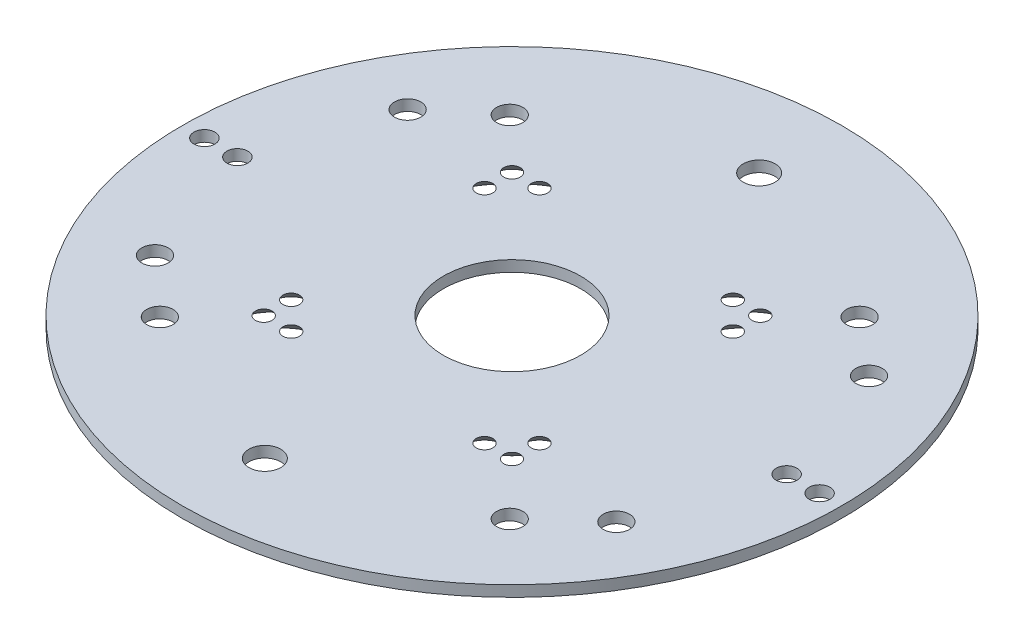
ISO-10303-21;
HEADER;
FILE_DESCRIPTION(('STEP AP214'),'2;1');
FILE_NAME('part.step','',(''),(''),'','','');
FILE_SCHEMA(('AUTOMOTIVE_DESIGN { 1 0 10303 214 1 1 1 1 }'));
ENDSEC;
DATA;
#1=APPLICATION_CONTEXT('core data for automotive mechanical design processes');
#2=APPLICATION_PROTOCOL_DEFINITION('international standard','automotive_design',2000,#1);
#3=PRODUCT_CONTEXT('',#1,'mechanical');
#4=PRODUCT('Part','Part','',(#3));
#5=PRODUCT_RELATED_PRODUCT_CATEGORY('part','',(#4));
#6=PRODUCT_DEFINITION_FORMATION('','',#4);
#7=PRODUCT_DEFINITION_CONTEXT('part definition',#1,'design');
#8=PRODUCT_DEFINITION('design','',#6,#7);
#9=PRODUCT_DEFINITION_SHAPE('','',#8);
#10=(LENGTH_UNIT() NAMED_UNIT(*) SI_UNIT(.MILLI.,.METRE.));
#11=(NAMED_UNIT(*) PLANE_ANGLE_UNIT() SI_UNIT($,.RADIAN.));
#12=(NAMED_UNIT(*) SI_UNIT($,.STERADIAN.) SOLID_ANGLE_UNIT());
#13=UNCERTAINTY_MEASURE_WITH_UNIT(LENGTH_MEASURE(1.E-05),#10,'distance_accuracy_value','');
#14=(GEOMETRIC_REPRESENTATION_CONTEXT(3) GLOBAL_UNCERTAINTY_ASSIGNED_CONTEXT((#13)) GLOBAL_UNIT_ASSIGNED_CONTEXT((#10,
#11,#12)) REPRESENTATION_CONTEXT('',''));
#15=CARTESIAN_POINT('',(0.,0.,0.));
#16=DIRECTION('',(0.,0.,1.));
#17=DIRECTION('',(1.,0.,0.));
#18=AXIS2_PLACEMENT_3D('',#15,#16,#17);
#19=CARTESIAN_POINT('',(0.,2.,0.));
#20=DIRECTION('',(0.,1.,0.));
#21=DIRECTION('',(0.,0.,1.));
#22=AXIS2_PLACEMENT_3D('',#19,#20,#21);
#23=PLANE('',#22);
#24=CARTESIAN_POINT('',(-42.,2.,23.));
#25=DIRECTION('',(0.,1.,0.));
#26=DIRECTION('',(0.,0.,1.));
#27=AXIS2_PLACEMENT_3D('',#24,#25,#26);
#28=CIRCLE('',#27,2.4);
#29=CARTESIAN_POINT('',(-42.,2.,25.4));
#30=VERTEX_POINT('',#29);
#31=EDGE_CURVE('E446',#30,#30,#28,.T.);
#32=ORIENTED_EDGE('',*,*,#31,.F.);
#33=EDGE_LOOP('',(#32));
#34=FACE_BOUND('',#33,.T.);
#35=CARTESIAN_POINT('',(41.9999999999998,2.,-23.0000000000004));
#36=DIRECTION('',(0.,1.,0.));
#37=DIRECTION('',(0.,0.,-1.));
#38=AXIS2_PLACEMENT_3D('',#35,#36,#37);
#39=CIRCLE('',#38,2.4);
#40=CARTESIAN_POINT('',(41.9999999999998,2.,-25.4000000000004));
#41=VERTEX_POINT('',#40);
#42=EDGE_CURVE('E439',#41,#41,#39,.T.);
#43=ORIENTED_EDGE('',*,*,#42,.F.);
#44=EDGE_LOOP('',(#43));
#45=FACE_BOUND('',#44,.T.);
#46=CARTESIAN_POINT('',(42.0000000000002,2.,22.9999999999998));
#47=DIRECTION('',(0.,1.,0.));
#48=DIRECTION('',(0.,0.,-1.));
#49=AXIS2_PLACEMENT_3D('',#46,#47,#48);
#50=CIRCLE('',#49,2.4);
#51=CARTESIAN_POINT('',(42.0000000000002,2.,20.5999999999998));
#52=VERTEX_POINT('',#51);
#53=EDGE_CURVE('E451',#52,#52,#50,.T.);
#54=ORIENTED_EDGE('',*,*,#53,.F.);
#55=EDGE_LOOP('',(#54));
#56=FACE_BOUND('',#55,.T.);
#57=CARTESIAN_POINT('',(-42.,2.,-23.));
#58=DIRECTION('',(0.,1.,0.));
#59=DIRECTION('',(0.,0.,1.));
#60=AXIS2_PLACEMENT_3D('',#57,#58,#59);
#61=CIRCLE('',#60,2.4);
#62=CARTESIAN_POINT('',(-42.,2.,-20.6));
#63=VERTEX_POINT('',#62);
#64=EDGE_CURVE('E433',#63,#63,#61,.T.);
#65=ORIENTED_EDGE('',*,*,#64,.F.);
#66=EDGE_LOOP('',(#65));
#67=FACE_BOUND('',#66,.T.);
#68=CARTESIAN_POINT('',(-31.8499999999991,2.,32.2628640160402));
#69=DIRECTION('',(0.,1.,0.));
#70=DIRECTION('',(0.,0.,1.));
#71=AXIS2_PLACEMENT_3D('',#68,#69,#70);
#72=CIRCLE('',#71,2.4);
#73=CARTESIAN_POINT('',(-31.8499999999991,2.,34.6628640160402));
#74=VERTEX_POINT('',#73);
#75=EDGE_CURVE('E415',#74,#74,#72,.T.);
#76=ORIENTED_EDGE('',*,*,#75,.F.);
#77=EDGE_LOOP('',(#76));
#78=FACE_BOUND('',#77,.T.);
#79=CARTESIAN_POINT('',(31.8500000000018,2.,32.2628640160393));
#80=DIRECTION('',(0.,1.,0.));
#81=DIRECTION('',(0.,0.,1.));
#82=AXIS2_PLACEMENT_3D('',#79,#80,#81);
#83=CIRCLE('',#82,2.4);
#84=CARTESIAN_POINT('',(31.8500000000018,2.,34.6628640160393));
#85=VERTEX_POINT('',#84);
#86=EDGE_CURVE('E422',#85,#85,#83,.T.);
#87=ORIENTED_EDGE('',*,*,#86,.F.);
#88=EDGE_LOOP('',(#87));
#89=FACE_BOUND('',#88,.T.);
#90=CARTESIAN_POINT('',(31.8500000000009,2.,-31.4371359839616));
#91=DIRECTION('',(0.,1.,0.));
#92=DIRECTION('',(0.,0.,1.));
#93=AXIS2_PLACEMENT_3D('',#90,#91,#92);
#94=CIRCLE('',#93,2.4);
#95=CARTESIAN_POINT('',(31.8500000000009,2.,-29.0371359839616));
#96=VERTEX_POINT('',#95);
#97=EDGE_CURVE('E428',#96,#96,#94,.T.);
#98=ORIENTED_EDGE('',*,*,#97,.F.);
#99=EDGE_LOOP('',(#98));
#100=FACE_BOUND('',#99,.T.);
#101=CARTESIAN_POINT('',(-31.85,2.,-31.4371359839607));
#102=DIRECTION('',(0.,1.,0.));
#103=DIRECTION('',(0.,0.,1.));
#104=AXIS2_PLACEMENT_3D('',#101,#102,#103);
#105=CIRCLE('',#104,2.4);
#106=CARTESIAN_POINT('',(-31.85,2.,-29.0371359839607));
#107=VERTEX_POINT('',#106);
#108=EDGE_CURVE('E409',#107,#107,#105,.T.);
#109=ORIENTED_EDGE('',*,*,#108,.F.);
#110=EDGE_LOOP('',(#109));
#111=FACE_BOUND('',#110,.T.);
#112=CARTESIAN_POINT('',(0.,2.,-45.));
#113=DIRECTION('',(0.,1.,0.));
#114=DIRECTION('',(0.,0.,1.));
#115=AXIS2_PLACEMENT_3D('',#112,#113,#114);
#116=CIRCLE('',#115,2.9);
#117=CARTESIAN_POINT('',(0.,2.,-42.1));
#118=VERTEX_POINT('',#117);
#119=EDGE_CURVE('E404',#118,#118,#116,.T.);
#120=ORIENTED_EDGE('',*,*,#119,.F.);
#121=EDGE_LOOP('',(#120));
#122=FACE_BOUND('',#121,.T.);
#123=CARTESIAN_POINT('',(0.,2.,45.));
#124=DIRECTION('',(0.,1.,0.));
#125=DIRECTION('',(0.,0.,1.));
#126=AXIS2_PLACEMENT_3D('',#123,#124,#125);
#127=CIRCLE('',#126,2.9);
#128=CARTESIAN_POINT('',(0.,2.,47.9));
#129=VERTEX_POINT('',#128);
#130=EDGE_CURVE('E397',#129,#129,#127,.T.);
#131=ORIENTED_EDGE('',*,*,#130,.F.);
#132=EDGE_LOOP('',(#131));
#133=FACE_BOUND('',#132,.T.);
#134=CARTESIAN_POINT('',(-56.,2.,0.));
#135=DIRECTION('',(0.,1.,0.));
#136=DIRECTION('',(0.,0.,1.));
#137=AXIS2_PLACEMENT_3D('',#134,#135,#136);
#138=CIRCLE('',#137,1.9);
#139=CARTESIAN_POINT('',(-56.,2.,1.9));
#140=VERTEX_POINT('',#139);
#141=EDGE_CURVE('E392',#140,#140,#138,.T.);
#142=ORIENTED_EDGE('',*,*,#141,.F.);
#143=EDGE_LOOP('',(#142));
#144=FACE_BOUND('',#143,.T.);
#145=CARTESIAN_POINT('',(56.,2.,0.));
#146=DIRECTION('',(0.,1.,0.));
#147=DIRECTION('',(0.,0.,1.));
#148=AXIS2_PLACEMENT_3D('',#145,#146,#147);
#149=CIRCLE('',#148,1.9);
#150=CARTESIAN_POINT('',(56.,2.,1.9));
#151=VERTEX_POINT('',#150);
#152=EDGE_CURVE('E385',#151,#151,#149,.T.);
#153=ORIENTED_EDGE('',*,*,#152,.F.);
#154=EDGE_LOOP('',(#153));
#155=FACE_BOUND('',#154,.T.);
#156=CARTESIAN_POINT('',(-50.,2.,0.));
#157=DIRECTION('',(0.,1.,0.));
#158=DIRECTION('',(0.,0.,1.));
#159=AXIS2_PLACEMENT_3D('',#156,#157,#158);
#160=CIRCLE('',#159,1.9);
#161=CARTESIAN_POINT('',(-50.,2.,1.9));
#162=VERTEX_POINT('',#161);
#163=EDGE_CURVE('E380',#162,#162,#160,.T.);
#164=ORIENTED_EDGE('',*,*,#163,.F.);
#165=EDGE_LOOP('',(#164));
#166=FACE_BOUND('',#165,.T.);
#167=CARTESIAN_POINT('',(50.,2.,0.));
#168=DIRECTION('',(0.,1.,0.));
#169=DIRECTION('',(0.,0.,1.));
#170=AXIS2_PLACEMENT_3D('',#167,#168,#169);
#171=CIRCLE('',#170,1.9);
#172=CARTESIAN_POINT('',(50.,2.,1.9));
#173=VERTEX_POINT('',#172);
#174=EDGE_CURVE('E373',#173,#173,#171,.T.);
#175=ORIENTED_EDGE('',*,*,#174,.F.);
#176=EDGE_LOOP('',(#175));
#177=FACE_BOUND('',#176,.T.);
#178=CARTESIAN_POINT('',(-22.599999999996,2.,17.6000000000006));
#179=DIRECTION('',(0.,1.,0.));
#180=DIRECTION('',(0.,0.,1.));
#181=AXIS2_PLACEMENT_3D('',#178,#179,#180);
#182=CIRCLE('',#181,1.5);
#183=CARTESIAN_POINT('',(-22.599999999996,2.,19.1000000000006));
#184=VERTEX_POINT('',#183);
#185=EDGE_CURVE('E367',#184,#184,#182,.T.);
#186=ORIENTED_EDGE('',*,*,#185,.F.);
#187=EDGE_LOOP('',(#186));
#188=FACE_BOUND('',#187,.T.);
#189=CARTESIAN_POINT('',(22.6000000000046,2.,17.5999999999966));
#190=DIRECTION('',(0.,1.,0.));
#191=DIRECTION('',(0.,0.,1.));
#192=AXIS2_PLACEMENT_3D('',#189,#190,#191);
#193=CIRCLE('',#192,1.5);
#194=CARTESIAN_POINT('',(22.6000000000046,2.,19.0999999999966));
#195=VERTEX_POINT('',#194);
#196=EDGE_CURVE('E361',#195,#195,#193,.T.);
#197=ORIENTED_EDGE('',*,*,#196,.F.);
#198=EDGE_LOOP('',(#197));
#199=FACE_BOUND('',#198,.T.);
#200=CARTESIAN_POINT('',(22.6000000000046,2.,22.5999999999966));
#201=DIRECTION('',(0.,1.,0.));
#202=DIRECTION('',(0.,0.,1.));
#203=AXIS2_PLACEMENT_3D('',#200,#201,#202);
#204=CIRCLE('',#203,1.5);
#205=CARTESIAN_POINT('',(22.6000000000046,2.,24.0999999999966));
#206=VERTEX_POINT('',#205);
#207=EDGE_CURVE('E355',#206,#206,#204,.T.);
#208=ORIENTED_EDGE('',*,*,#207,.F.);
#209=EDGE_LOOP('',(#208));
#210=FACE_BOUND('',#209,.T.);
#211=CARTESIAN_POINT('',(22.6000000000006,2.,-17.600000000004));
#212=DIRECTION('',(0.,1.,0.));
#213=DIRECTION('',(0.,0.,1.));
#214=AXIS2_PLACEMENT_3D('',#211,#212,#213);
#215=CIRCLE('',#214,1.5);
#216=CARTESIAN_POINT('',(22.6000000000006,2.,-16.100000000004));
#217=VERTEX_POINT('',#216);
#218=EDGE_CURVE('E349',#217,#217,#215,.T.);
#219=ORIENTED_EDGE('',*,*,#218,.F.);
#220=EDGE_LOOP('',(#219));
#221=FACE_BOUND('',#220,.T.);
#222=CARTESIAN_POINT('',(-22.6,2.,-17.6));
#223=DIRECTION('',(0.,1.,0.));
#224=DIRECTION('',(0.,0.,1.));
#225=AXIS2_PLACEMENT_3D('',#222,#223,#224);
#226=CIRCLE('',#225,1.5);
#227=CARTESIAN_POINT('',(-22.6,2.,-16.1));
#228=VERTEX_POINT('',#227);
#229=EDGE_CURVE('E343',#228,#228,#226,.T.);
#230=ORIENTED_EDGE('',*,*,#229,.F.);
#231=EDGE_LOOP('',(#230));
#232=FACE_BOUND('',#231,.T.);
#233=CARTESIAN_POINT('',(-22.6,2.,-22.6));
#234=DIRECTION('',(0.,1.,0.));
#235=DIRECTION('',(0.,0.,1.));
#236=AXIS2_PLACEMENT_3D('',#233,#234,#235);
#237=CIRCLE('',#236,1.5);
#238=CARTESIAN_POINT('',(-22.6,2.,-21.1));
#239=VERTEX_POINT('',#238);
#240=EDGE_CURVE('E336',#239,#239,#237,.T.);
#241=ORIENTED_EDGE('',*,*,#240,.F.);
#242=EDGE_LOOP('',(#241));
#243=FACE_BOUND('',#242,.T.);
#244=CARTESIAN_POINT('',(0.,2.,0.));
#245=DIRECTION('',(0.,1.,0.));
#246=DIRECTION('',(0.,0.,1.));
#247=AXIS2_PLACEMENT_3D('',#244,#245,#246);
#248=CIRCLE('',#247,60.);
#249=CARTESIAN_POINT('',(0.,2.,60.));
#250=VERTEX_POINT('',#249);
#251=EDGE_CURVE('E119',#250,#250,#248,.T.);
#252=ORIENTED_EDGE('',*,*,#251,.T.);
#253=EDGE_LOOP('',(#252));
#254=FACE_BOUND('',#253,.T.);
#255=CARTESIAN_POINT('',(0.,2.,0.));
#256=DIRECTION('',(0.,1.,0.));
#257=DIRECTION('',(0.,0.,1.));
#258=AXIS2_PLACEMENT_3D('',#255,#256,#257);
#259=CIRCLE('',#258,12.5);
#260=CARTESIAN_POINT('',(0.,2.,12.5));
#261=VERTEX_POINT('',#260);
#262=EDGE_CURVE('E328',#261,#261,#259,.T.);
#263=ORIENTED_EDGE('',*,*,#262,.F.);
#264=EDGE_LOOP('',(#263));
#265=FACE_BOUND('',#264,.T.);
#266=CARTESIAN_POINT('',(-17.6,2.,-22.6));
#267=DIRECTION('',(0.,1.,0.));
#268=DIRECTION('',(0.,0.,1.));
#269=AXIS2_PLACEMENT_3D('',#266,#267,#268);
#270=CIRCLE('',#269,1.5);
#271=CARTESIAN_POINT('',(-17.6,2.,-21.1));
#272=VERTEX_POINT('',#271);
#273=EDGE_CURVE('E340',#272,#272,#270,.T.);
#274=ORIENTED_EDGE('',*,*,#273,.F.);
#275=EDGE_LOOP('',(#274));
#276=FACE_BOUND('',#275,.T.);
#277=CARTESIAN_POINT('',(22.6000000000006,2.,-22.600000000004));
#278=DIRECTION('',(0.,1.,0.));
#279=DIRECTION('',(0.,0.,1.));
#280=AXIS2_PLACEMENT_3D('',#277,#278,#279);
#281=CIRCLE('',#280,1.5);
#282=CARTESIAN_POINT('',(22.6000000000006,2.,-21.100000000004));
#283=VERTEX_POINT('',#282);
#284=EDGE_CURVE('E346',#283,#283,#281,.T.);
#285=ORIENTED_EDGE('',*,*,#284,.F.);
#286=EDGE_LOOP('',(#285));
#287=FACE_BOUND('',#286,.T.);
#288=CARTESIAN_POINT('',(17.6000000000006,2.,-22.600000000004));
#289=DIRECTION('',(0.,1.,0.));
#290=DIRECTION('',(0.,0.,1.));
#291=AXIS2_PLACEMENT_3D('',#288,#289,#290);
#292=CIRCLE('',#291,1.5);
#293=CARTESIAN_POINT('',(17.6000000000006,2.,-21.100000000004));
#294=VERTEX_POINT('',#293);
#295=EDGE_CURVE('E352',#294,#294,#292,.T.);
#296=ORIENTED_EDGE('',*,*,#295,.F.);
#297=EDGE_LOOP('',(#296));
#298=FACE_BOUND('',#297,.T.);
#299=CARTESIAN_POINT('',(17.6000000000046,2.,22.5999999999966));
#300=DIRECTION('',(0.,1.,0.));
#301=DIRECTION('',(0.,0.,1.));
#302=AXIS2_PLACEMENT_3D('',#299,#300,#301);
#303=CIRCLE('',#302,1.5);
#304=CARTESIAN_POINT('',(17.6000000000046,2.,24.0999999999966));
#305=VERTEX_POINT('',#304);
#306=EDGE_CURVE('E358',#305,#305,#303,.T.);
#307=ORIENTED_EDGE('',*,*,#306,.F.);
#308=EDGE_LOOP('',(#307));
#309=FACE_BOUND('',#308,.T.);
#310=CARTESIAN_POINT('',(-22.599999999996,2.,22.6000000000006));
#311=DIRECTION('',(0.,1.,0.));
#312=DIRECTION('',(0.,0.,1.));
#313=AXIS2_PLACEMENT_3D('',#310,#311,#312);
#314=CIRCLE('',#313,1.5);
#315=CARTESIAN_POINT('',(-22.599999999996,2.,24.1000000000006));
#316=VERTEX_POINT('',#315);
#317=EDGE_CURVE('E364',#316,#316,#314,.T.);
#318=ORIENTED_EDGE('',*,*,#317,.F.);
#319=EDGE_LOOP('',(#318));
#320=FACE_BOUND('',#319,.T.);
#321=CARTESIAN_POINT('',(-17.599999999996,2.,22.6000000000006));
#322=DIRECTION('',(0.,1.,0.));
#323=DIRECTION('',(0.,0.,1.));
#324=AXIS2_PLACEMENT_3D('',#321,#322,#323);
#325=CIRCLE('',#324,1.5);
#326=CARTESIAN_POINT('',(-17.599999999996,2.,24.1000000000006));
#327=VERTEX_POINT('',#326);
#328=EDGE_CURVE('E370',#327,#327,#325,.T.);
#329=ORIENTED_EDGE('',*,*,#328,.F.);
#330=EDGE_LOOP('',(#329));
#331=FACE_BOUND('',#330,.T.);
#332=ADVANCED_FACE('F34',(#34,#45,#56,#67,#78,#89,#100,#111,#122,#133,#144,#155,#166,#177,#188,
#199,#210,#221,#232,#243,#254,#265,#276,#287,#298,#309,#320,#331),#23,.T.);
#333=CARTESIAN_POINT('',(0.,0.,0.));
#334=DIRECTION('',(0.,1.,0.));
#335=DIRECTION('',(0.,0.,1.));
#336=AXIS2_PLACEMENT_3D('',#333,#334,#335);
#337=PLANE('',#336);
#338=CARTESIAN_POINT('',(-22.6,0.,-22.6));
#339=DIRECTION('',(0.,1.,0.));
#340=DIRECTION('',(0.,0.,1.));
#341=AXIS2_PLACEMENT_3D('',#338,#339,#340);
#342=CIRCLE('',#341,3.5);
#343=CARTESIAN_POINT('',(-20.1505102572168,0.,-20.1));
#344=VERTEX_POINT('',#343);
#345=CARTESIAN_POINT('',(-20.1,0.,-20.1505102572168));
#346=VERTEX_POINT('',#345);
#347=EDGE_CURVE('E48',#344,#346,#342,.T.);
#348=ORIENTED_EDGE('',*,*,#347,.T.);
#349=CARTESIAN_POINT('',(-17.6,0.,-22.6));
#350=DIRECTION('',(0.,1.,0.));
#351=DIRECTION('',(0.,0.,1.));
#352=AXIS2_PLACEMENT_3D('',#349,#350,#351);
#353=CIRCLE('',#352,3.5);
#354=CARTESIAN_POINT('',(-20.1,0.,-25.0494897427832));
#355=VERTEX_POINT('',#354);
#356=EDGE_CURVE('E11',#346,#355,#353,.T.);
#357=ORIENTED_EDGE('',*,*,#356,.T.);
#358=CARTESIAN_POINT('',(-22.6,0.,-22.6));
#359=DIRECTION('',(0.,1.,0.));
#360=DIRECTION('',(0.,0.,1.));
#361=AXIS2_PLACEMENT_3D('',#358,#359,#360);
#362=CIRCLE('',#361,3.5);
#363=CARTESIAN_POINT('',(-25.0494897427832,0.,-20.1));
#364=VERTEX_POINT('',#363);
#365=EDGE_CURVE('E148',#355,#364,#362,.T.);
#366=ORIENTED_EDGE('',*,*,#365,.T.);
#367=CARTESIAN_POINT('',(-22.6,0.,-17.6));
#368=DIRECTION('',(0.,1.,0.));
#369=DIRECTION('',(0.,0.,1.));
#370=AXIS2_PLACEMENT_3D('',#367,#368,#369);
#371=CIRCLE('',#370,3.5);
#372=EDGE_CURVE('E146',#364,#344,#371,.T.);
#373=ORIENTED_EDGE('',*,*,#372,.T.);
#374=EDGE_LOOP('',(#348,#357,#366,#373));
#375=FACE_BOUND('',#374,.T.);
#376=CARTESIAN_POINT('',(22.6000000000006,0.,-22.600000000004));
#377=DIRECTION('',(0.,1.,0.));
#378=DIRECTION('',(0.,0.,1.));
#379=AXIS2_PLACEMENT_3D('',#376,#377,#378);
#380=CIRCLE('',#379,3.5);
#381=CARTESIAN_POINT('',(25.0494897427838,0.,-20.100000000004));
#382=VERTEX_POINT('',#381);
#383=CARTESIAN_POINT('',(20.1000000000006,0.,-25.0494897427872));
#384=VERTEX_POINT('',#383);
#385=EDGE_CURVE('E141',#382,#384,#380,.T.);
#386=ORIENTED_EDGE('',*,*,#385,.T.);
#387=CARTESIAN_POINT('',(17.6000000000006,0.,-22.600000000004));
#388=DIRECTION('',(0.,1.,0.));
#389=DIRECTION('',(0.,0.,1.));
#390=AXIS2_PLACEMENT_3D('',#387,#388,#389);
#391=CIRCLE('',#390,3.5);
#392=CARTESIAN_POINT('',(20.1000000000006,0.,-20.1505102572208));
#393=VERTEX_POINT('',#392);
#394=EDGE_CURVE('E143',#384,#393,#391,.T.);
#395=ORIENTED_EDGE('',*,*,#394,.T.);
#396=CARTESIAN_POINT('',(22.6000000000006,0.,-22.600000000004));
#397=DIRECTION('',(0.,1.,0.));
#398=DIRECTION('',(0.,0.,1.));
#399=AXIS2_PLACEMENT_3D('',#396,#397,#398);
#400=CIRCLE('',#399,3.5);
#401=CARTESIAN_POINT('',(20.1505102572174,0.,-20.100000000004));
#402=VERTEX_POINT('',#401);
#403=EDGE_CURVE('E139',#393,#402,#400,.T.);
#404=ORIENTED_EDGE('',*,*,#403,.T.);
#405=CARTESIAN_POINT('',(22.6000000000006,0.,-17.600000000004));
#406=DIRECTION('',(0.,1.,0.));
#407=DIRECTION('',(0.,0.,1.));
#408=AXIS2_PLACEMENT_3D('',#405,#406,#407);
#409=CIRCLE('',#408,3.5);
#410=EDGE_CURVE('E137',#402,#382,#409,.T.);
#411=ORIENTED_EDGE('',*,*,#410,.T.);
#412=EDGE_LOOP('',(#386,#395,#404,#411));
#413=FACE_BOUND('',#412,.T.);
#414=CARTESIAN_POINT('',(22.6000000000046,0.,22.5999999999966));
#415=DIRECTION('',(0.,1.,0.));
#416=DIRECTION('',(0.,0.,1.));
#417=AXIS2_PLACEMENT_3D('',#414,#415,#416);
#418=CIRCLE('',#417,3.5);
#419=CARTESIAN_POINT('',(20.1000000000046,0.,25.0494897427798));
#420=VERTEX_POINT('',#419);
#421=CARTESIAN_POINT('',(25.0494897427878,0.,20.0999999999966));
#422=VERTEX_POINT('',#421);
#423=EDGE_CURVE('E132',#420,#422,#418,.T.);
#424=ORIENTED_EDGE('',*,*,#423,.T.);
#425=CARTESIAN_POINT('',(22.6000000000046,0.,17.5999999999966));
#426=DIRECTION('',(0.,1.,0.));
#427=DIRECTION('',(0.,0.,1.));
#428=AXIS2_PLACEMENT_3D('',#425,#426,#427);
#429=CIRCLE('',#428,3.5);
#430=CARTESIAN_POINT('',(20.1505102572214,0.,20.0999999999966));
#431=VERTEX_POINT('',#430);
#432=EDGE_CURVE('E134',#422,#431,#429,.T.);
#433=ORIENTED_EDGE('',*,*,#432,.T.);
#434=CARTESIAN_POINT('',(22.6000000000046,0.,22.5999999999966));
#435=DIRECTION('',(0.,1.,0.));
#436=DIRECTION('',(0.,0.,1.));
#437=AXIS2_PLACEMENT_3D('',#434,#435,#436);
#438=CIRCLE('',#437,3.5);
#439=CARTESIAN_POINT('',(20.1000000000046,0.,20.1505102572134));
#440=VERTEX_POINT('',#439);
#441=EDGE_CURVE('E130',#431,#440,#438,.T.);
#442=ORIENTED_EDGE('',*,*,#441,.T.);
#443=CARTESIAN_POINT('',(17.6000000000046,0.,22.5999999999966));
#444=DIRECTION('',(0.,1.,0.));
#445=DIRECTION('',(0.,0.,1.));
#446=AXIS2_PLACEMENT_3D('',#443,#444,#445);
#447=CIRCLE('',#446,3.5);
#448=EDGE_CURVE('E125',#440,#420,#447,.T.);
#449=ORIENTED_EDGE('',*,*,#448,.T.);
#450=EDGE_LOOP('',(#424,#433,#442,#449));
#451=FACE_BOUND('',#450,.T.);
#452=CARTESIAN_POINT('',(-17.599999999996,0.,22.6000000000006));
#453=DIRECTION('',(0.,1.,0.));
#454=DIRECTION('',(0.,0.,1.));
#455=AXIS2_PLACEMENT_3D('',#452,#453,#454);
#456=CIRCLE('',#455,3.5);
#457=CARTESIAN_POINT('',(-20.099999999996,0.,25.0494897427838));
#458=VERTEX_POINT('',#457);
#459=CARTESIAN_POINT('',(-20.099999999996,0.,20.1505102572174));
#460=VERTEX_POINT('',#459);
#461=EDGE_CURVE('E118',#458,#460,#456,.T.);
#462=ORIENTED_EDGE('',*,*,#461,.T.);
#463=CARTESIAN_POINT('',(-22.599999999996,0.,22.6000000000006));
#464=DIRECTION('',(0.,1.,0.));
#465=DIRECTION('',(0.,0.,1.));
#466=AXIS2_PLACEMENT_3D('',#463,#464,#465);
#467=CIRCLE('',#466,3.5);
#468=CARTESIAN_POINT('',(-20.1505102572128,0.,20.1000000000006));
#469=VERTEX_POINT('',#468);
#470=EDGE_CURVE('E123',#460,#469,#467,.T.);
#471=ORIENTED_EDGE('',*,*,#470,.T.);
#472=CARTESIAN_POINT('',(-22.599999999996,0.,17.6000000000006));
#473=DIRECTION('',(0.,1.,0.));
#474=DIRECTION('',(0.,0.,1.));
#475=AXIS2_PLACEMENT_3D('',#472,#473,#474);
#476=CIRCLE('',#475,3.5);
#477=CARTESIAN_POINT('',(-25.0494897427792,0.,20.1000000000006));
#478=VERTEX_POINT('',#477);
#479=EDGE_CURVE('E109',#469,#478,#476,.T.);
#480=ORIENTED_EDGE('',*,*,#479,.T.);
#481=CARTESIAN_POINT('',(-22.599999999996,0.,22.6000000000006));
#482=DIRECTION('',(0.,1.,0.));
#483=DIRECTION('',(0.,0.,1.));
#484=AXIS2_PLACEMENT_3D('',#481,#482,#483);
#485=CIRCLE('',#484,3.5);
#486=EDGE_CURVE('E113',#478,#458,#485,.T.);
#487=ORIENTED_EDGE('',*,*,#486,.T.);
#488=EDGE_LOOP('',(#462,#471,#480,#487));
#489=FACE_BOUND('',#488,.T.);
#490=CARTESIAN_POINT('',(-42.,0.,23.));
#491=DIRECTION('',(0.,1.,0.));
#492=DIRECTION('',(0.,0.,1.));
#493=AXIS2_PLACEMENT_3D('',#490,#491,#492);
#494=CIRCLE('',#493,2.4);
#495=CARTESIAN_POINT('',(-42.,0.,25.4));
#496=VERTEX_POINT('',#495);
#497=EDGE_CURVE('E436',#496,#496,#494,.T.);
#498=ORIENTED_EDGE('',*,*,#497,.T.);
#499=EDGE_LOOP('',(#498));
#500=FACE_BOUND('',#499,.T.);
#501=CARTESIAN_POINT('',(41.9999999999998,0.,-23.0000000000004));
#502=DIRECTION('',(0.,1.,0.));
#503=DIRECTION('',(0.,0.,-1.));
#504=AXIS2_PLACEMENT_3D('',#501,#502,#503);
#505=CIRCLE('',#504,2.4);
#506=CARTESIAN_POINT('',(41.9999999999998,0.,-25.4000000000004));
#507=VERTEX_POINT('',#506);
#508=EDGE_CURVE('E442',#507,#507,#505,.T.);
#509=ORIENTED_EDGE('',*,*,#508,.T.);
#510=EDGE_LOOP('',(#509));
#511=FACE_BOUND('',#510,.T.);
#512=CARTESIAN_POINT('',(42.0000000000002,0.,22.9999999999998));
#513=DIRECTION('',(0.,1.,0.));
#514=DIRECTION('',(0.,0.,-1.));
#515=AXIS2_PLACEMENT_3D('',#512,#513,#514);
#516=CIRCLE('',#515,2.4);
#517=CARTESIAN_POINT('',(42.0000000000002,0.,20.5999999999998));
#518=VERTEX_POINT('',#517);
#519=EDGE_CURVE('E443',#518,#518,#516,.T.);
#520=ORIENTED_EDGE('',*,*,#519,.T.);
#521=EDGE_LOOP('',(#520));
#522=FACE_BOUND('',#521,.T.);
#523=CARTESIAN_POINT('',(-42.,0.,-23.));
#524=DIRECTION('',(0.,1.,0.));
#525=DIRECTION('',(0.,0.,1.));
#526=AXIS2_PLACEMENT_3D('',#523,#524,#525);
#527=CIRCLE('',#526,2.4);
#528=CARTESIAN_POINT('',(-42.,0.,-20.6));
#529=VERTEX_POINT('',#528);
#530=EDGE_CURVE('E419',#529,#529,#527,.T.);
#531=ORIENTED_EDGE('',*,*,#530,.T.);
#532=EDGE_LOOP('',(#531));
#533=FACE_BOUND('',#532,.T.);
#534=CARTESIAN_POINT('',(-31.8499999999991,0.,32.2628640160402));
#535=DIRECTION('',(0.,1.,0.));
#536=DIRECTION('',(0.,0.,1.));
#537=AXIS2_PLACEMENT_3D('',#534,#535,#536);
#538=CIRCLE('',#537,2.4);
#539=CARTESIAN_POINT('',(-31.8499999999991,0.,34.6628640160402));
#540=VERTEX_POINT('',#539);
#541=EDGE_CURVE('E418',#540,#540,#538,.T.);
#542=ORIENTED_EDGE('',*,*,#541,.T.);
#543=EDGE_LOOP('',(#542));
#544=FACE_BOUND('',#543,.T.);
#545=CARTESIAN_POINT('',(31.8500000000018,0.,32.2628640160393));
#546=DIRECTION('',(0.,1.,0.));
#547=DIRECTION('',(0.,0.,1.));
#548=AXIS2_PLACEMENT_3D('',#545,#546,#547);
#549=CIRCLE('',#548,2.4);
#550=CARTESIAN_POINT('',(31.8500000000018,0.,34.6628640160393));
#551=VERTEX_POINT('',#550);
#552=EDGE_CURVE('E425',#551,#551,#549,.T.);
#553=ORIENTED_EDGE('',*,*,#552,.T.);
#554=EDGE_LOOP('',(#553));
#555=FACE_BOUND('',#554,.T.);
#556=CARTESIAN_POINT('',(31.8500000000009,0.,-31.4371359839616));
#557=DIRECTION('',(0.,1.,0.));
#558=DIRECTION('',(0.,0.,1.));
#559=AXIS2_PLACEMENT_3D('',#556,#557,#558);
#560=CIRCLE('',#559,2.4);
#561=CARTESIAN_POINT('',(31.8500000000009,0.,-29.0371359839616));
#562=VERTEX_POINT('',#561);
#563=EDGE_CURVE('E412',#562,#562,#560,.T.);
#564=ORIENTED_EDGE('',*,*,#563,.T.);
#565=EDGE_LOOP('',(#564));
#566=FACE_BOUND('',#565,.T.);
#567=CARTESIAN_POINT('',(-31.85,0.,-31.4371359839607));
#568=DIRECTION('',(0.,1.,0.));
#569=DIRECTION('',(0.,0.,1.));
#570=AXIS2_PLACEMENT_3D('',#567,#568,#569);
#571=CIRCLE('',#570,2.4);
#572=CARTESIAN_POINT('',(-31.85,0.,-29.0371359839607));
#573=VERTEX_POINT('',#572);
#574=EDGE_CURVE('E401',#573,#573,#571,.T.);
#575=ORIENTED_EDGE('',*,*,#574,.T.);
#576=EDGE_LOOP('',(#575));
#577=FACE_BOUND('',#576,.T.);
#578=CARTESIAN_POINT('',(0.,0.,-45.));
#579=DIRECTION('',(0.,1.,0.));
#580=DIRECTION('',(0.,0.,1.));
#581=AXIS2_PLACEMENT_3D('',#578,#579,#580);
#582=CIRCLE('',#581,2.9);
#583=CARTESIAN_POINT('',(0.,0.,-42.1));
#584=VERTEX_POINT('',#583);
#585=EDGE_CURVE('E389',#584,#584,#582,.T.);
#586=ORIENTED_EDGE('',*,*,#585,.T.);
#587=EDGE_LOOP('',(#586));
#588=FACE_BOUND('',#587,.T.);
#589=CARTESIAN_POINT('',(0.,0.,45.));
#590=DIRECTION('',(0.,1.,0.));
#591=DIRECTION('',(0.,0.,1.));
#592=AXIS2_PLACEMENT_3D('',#589,#590,#591);
#593=CIRCLE('',#592,2.9);
#594=CARTESIAN_POINT('',(0.,0.,47.9));
#595=VERTEX_POINT('',#594);
#596=EDGE_CURVE('E400',#595,#595,#593,.T.);
#597=ORIENTED_EDGE('',*,*,#596,.T.);
#598=EDGE_LOOP('',(#597));
#599=FACE_BOUND('',#598,.T.);
#600=CARTESIAN_POINT('',(-56.,0.,0.));
#601=DIRECTION('',(0.,1.,0.));
#602=DIRECTION('',(0.,0.,1.));
#603=AXIS2_PLACEMENT_3D('',#600,#601,#602);
#604=CIRCLE('',#603,1.9);
#605=CARTESIAN_POINT('',(-56.,0.,1.9));
#606=VERTEX_POINT('',#605);
#607=EDGE_CURVE('E377',#606,#606,#604,.T.);
#608=ORIENTED_EDGE('',*,*,#607,.T.);
#609=EDGE_LOOP('',(#608));
#610=FACE_BOUND('',#609,.T.);
#611=CARTESIAN_POINT('',(56.,0.,0.));
#612=DIRECTION('',(0.,1.,0.));
#613=DIRECTION('',(0.,0.,1.));
#614=AXIS2_PLACEMENT_3D('',#611,#612,#613);
#615=CIRCLE('',#614,1.9);
#616=CARTESIAN_POINT('',(56.,0.,1.9));
#617=VERTEX_POINT('',#616);
#618=EDGE_CURVE('E388',#617,#617,#615,.T.);
#619=ORIENTED_EDGE('',*,*,#618,.T.);
#620=EDGE_LOOP('',(#619));
#621=FACE_BOUND('',#620,.T.);
#622=CARTESIAN_POINT('',(-50.,0.,0.));
#623=DIRECTION('',(0.,1.,0.));
#624=DIRECTION('',(0.,0.,1.));
#625=AXIS2_PLACEMENT_3D('',#622,#623,#624);
#626=CIRCLE('',#625,1.9);
#627=CARTESIAN_POINT('',(-50.,0.,1.9));
#628=VERTEX_POINT('',#627);
#629=EDGE_CURVE('E372',#628,#628,#626,.T.);
#630=ORIENTED_EDGE('',*,*,#629,.T.);
#631=EDGE_LOOP('',(#630));
#632=FACE_BOUND('',#631,.T.);
#633=CARTESIAN_POINT('',(50.,0.,0.));
#634=DIRECTION('',(0.,1.,0.));
#635=DIRECTION('',(0.,0.,1.));
#636=AXIS2_PLACEMENT_3D('',#633,#634,#635);
#637=CIRCLE('',#636,1.9);
#638=CARTESIAN_POINT('',(50.,0.,1.9));
#639=VERTEX_POINT('',#638);
#640=EDGE_CURVE('E376',#639,#639,#637,.T.);
#641=ORIENTED_EDGE('',*,*,#640,.T.);
#642=EDGE_LOOP('',(#641));
#643=FACE_BOUND('',#642,.T.);
#644=CARTESIAN_POINT('',(0.,0.,0.));
#645=DIRECTION('',(0.,1.,0.));
#646=DIRECTION('',(0.,0.,1.));
#647=AXIS2_PLACEMENT_3D('',#644,#645,#646);
#648=CIRCLE('',#647,60.);
#649=CARTESIAN_POINT('',(0.,0.,60.));
#650=VERTEX_POINT('',#649);
#651=EDGE_CURVE('E326',#650,#650,#648,.T.);
#652=ORIENTED_EDGE('',*,*,#651,.F.);
#653=EDGE_LOOP('',(#652));
#654=FACE_BOUND('',#653,.T.);
#655=CARTESIAN_POINT('',(0.,0.,0.));
#656=DIRECTION('',(0.,1.,0.));
#657=DIRECTION('',(0.,0.,1.));
#658=AXIS2_PLACEMENT_3D('',#655,#656,#657);
#659=CIRCLE('',#658,12.5);
#660=CARTESIAN_POINT('',(0.,0.,12.5));
#661=VERTEX_POINT('',#660);
#662=EDGE_CURVE('E332',#661,#661,#659,.T.);
#663=ORIENTED_EDGE('',*,*,#662,.T.);
#664=EDGE_LOOP('',(#663));
#665=FACE_BOUND('',#664,.T.);
#666=ADVANCED_FACE('F121',(#375,#413,#451,#489,#500,#511,#522,#533,#544,#555,#566,#577,#588,
#599,#610,#621,#632,#643,#654,#665),#337,.F.);
#667=CARTESIAN_POINT('',(0.,2.,0.));
#668=DIRECTION('',(0.,-1.,0.));
#669=DIRECTION('',(0.,0.,-1.));
#670=AXIS2_PLACEMENT_3D('',#667,#668,#669);
#671=CYLINDRICAL_SURFACE('',#670,60.);
#672=ORIENTED_EDGE('',*,*,#251,.F.);
#673=EDGE_LOOP('',(#672));
#674=FACE_BOUND('',#673,.T.);
#675=ORIENTED_EDGE('',*,*,#651,.T.);
#676=EDGE_LOOP('',(#675));
#677=FACE_BOUND('',#676,.T.);
#678=ADVANCED_FACE('F307',(#674,#677),#671,.T.);
#679=CARTESIAN_POINT('',(0.,2.,0.));
#680=DIRECTION('',(0.,-1.,0.));
#681=DIRECTION('',(0.,0.,-1.));
#682=AXIS2_PLACEMENT_3D('',#679,#680,#681);
#683=CYLINDRICAL_SURFACE('',#682,12.5);
#684=ORIENTED_EDGE('',*,*,#262,.T.);
#685=EDGE_LOOP('',(#684));
#686=FACE_BOUND('',#685,.T.);
#687=ORIENTED_EDGE('',*,*,#662,.F.);
#688=EDGE_LOOP('',(#687));
#689=FACE_BOUND('',#688,.T.);
#690=ADVANCED_FACE('F312',(#686,#689),#683,.F.);
#691=CARTESIAN_POINT('',(50.,0.,0.));
#692=DIRECTION('',(0.,1.,0.));
#693=DIRECTION('',(0.,0.,1.));
#694=AXIS2_PLACEMENT_3D('',#691,#692,#693);
#695=CYLINDRICAL_SURFACE('',#694,1.9);
#696=ORIENTED_EDGE('',*,*,#640,.F.);
#697=EDGE_LOOP('',(#696));
#698=FACE_BOUND('',#697,.T.);
#699=ORIENTED_EDGE('',*,*,#174,.T.);
#700=EDGE_LOOP('',(#699));
#701=FACE_BOUND('',#700,.T.);
#702=ADVANCED_FACE('F319',(#698,#701),#695,.F.);
#703=CARTESIAN_POINT('',(-50.,0.,0.));
#704=DIRECTION('',(0.,1.,0.));
#705=DIRECTION('',(0.,0.,1.));
#706=AXIS2_PLACEMENT_3D('',#703,#704,#705);
#707=CYLINDRICAL_SURFACE('',#706,1.9);
#708=ORIENTED_EDGE('',*,*,#629,.F.);
#709=EDGE_LOOP('',(#708));
#710=FACE_BOUND('',#709,.T.);
#711=ORIENTED_EDGE('',*,*,#163,.T.);
#712=EDGE_LOOP('',(#711));
#713=FACE_BOUND('',#712,.T.);
#714=ADVANCED_FACE('F661',(#710,#713),#707,.F.);
#715=CARTESIAN_POINT('',(56.,0.,0.));
#716=DIRECTION('',(0.,1.,0.));
#717=DIRECTION('',(0.,0.,1.));
#718=AXIS2_PLACEMENT_3D('',#715,#716,#717);
#719=CYLINDRICAL_SURFACE('',#718,1.9);
#720=ORIENTED_EDGE('',*,*,#618,.F.);
#721=EDGE_LOOP('',(#720));
#722=FACE_BOUND('',#721,.T.);
#723=ORIENTED_EDGE('',*,*,#152,.T.);
#724=EDGE_LOOP('',(#723));
#725=FACE_BOUND('',#724,.T.);
#726=ADVANCED_FACE('F653',(#722,#725),#719,.F.);
#727=CARTESIAN_POINT('',(-56.,0.,0.));
#728=DIRECTION('',(0.,1.,0.));
#729=DIRECTION('',(0.,0.,1.));
#730=AXIS2_PLACEMENT_3D('',#727,#728,#729);
#731=CYLINDRICAL_SURFACE('',#730,1.9);
#732=ORIENTED_EDGE('',*,*,#607,.F.);
#733=EDGE_LOOP('',(#732));
#734=FACE_BOUND('',#733,.T.);
#735=ORIENTED_EDGE('',*,*,#141,.T.);
#736=EDGE_LOOP('',(#735));
#737=FACE_BOUND('',#736,.T.);
#738=ADVANCED_FACE('F645',(#734,#737),#731,.F.);
#739=CARTESIAN_POINT('',(0.,0.,45.));
#740=DIRECTION('',(0.,1.,0.));
#741=DIRECTION('',(0.,0.,1.));
#742=AXIS2_PLACEMENT_3D('',#739,#740,#741);
#743=CYLINDRICAL_SURFACE('',#742,2.9);
#744=ORIENTED_EDGE('',*,*,#596,.F.);
#745=EDGE_LOOP('',(#744));
#746=FACE_BOUND('',#745,.T.);
#747=ORIENTED_EDGE('',*,*,#130,.T.);
#748=EDGE_LOOP('',(#747));
#749=FACE_BOUND('',#748,.T.);
#750=ADVANCED_FACE('F637',(#746,#749),#743,.F.);
#751=CARTESIAN_POINT('',(0.,0.,-45.));
#752=DIRECTION('',(0.,1.,0.));
#753=DIRECTION('',(0.,0.,1.));
#754=AXIS2_PLACEMENT_3D('',#751,#752,#753);
#755=CYLINDRICAL_SURFACE('',#754,2.9);
#756=ORIENTED_EDGE('',*,*,#585,.F.);
#757=EDGE_LOOP('',(#756));
#758=FACE_BOUND('',#757,.T.);
#759=ORIENTED_EDGE('',*,*,#119,.T.);
#760=EDGE_LOOP('',(#759));
#761=FACE_BOUND('',#760,.T.);
#762=ADVANCED_FACE('F629',(#758,#761),#755,.F.);
#763=CARTESIAN_POINT('',(-31.85,0.,-31.4371359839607));
#764=DIRECTION('',(0.,1.,0.));
#765=DIRECTION('',(0.,0.,1.));
#766=AXIS2_PLACEMENT_3D('',#763,#764,#765);
#767=CYLINDRICAL_SURFACE('',#766,2.4);
#768=ORIENTED_EDGE('',*,*,#574,.F.);
#769=EDGE_LOOP('',(#768));
#770=FACE_BOUND('',#769,.T.);
#771=ORIENTED_EDGE('',*,*,#108,.T.);
#772=EDGE_LOOP('',(#771));
#773=FACE_BOUND('',#772,.T.);
#774=ADVANCED_FACE('F621',(#770,#773),#767,.F.);
#775=CARTESIAN_POINT('',(31.8500000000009,0.,-31.4371359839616));
#776=DIRECTION('',(0.,1.,0.));
#777=DIRECTION('',(0.,0.,1.));
#778=AXIS2_PLACEMENT_3D('',#775,#776,#777);
#779=CYLINDRICAL_SURFACE('',#778,2.4);
#780=ORIENTED_EDGE('',*,*,#563,.F.);
#781=EDGE_LOOP('',(#780));
#782=FACE_BOUND('',#781,.T.);
#783=ORIENTED_EDGE('',*,*,#97,.T.);
#784=EDGE_LOOP('',(#783));
#785=FACE_BOUND('',#784,.T.);
#786=ADVANCED_FACE('F613',(#782,#785),#779,.F.);
#787=CARTESIAN_POINT('',(31.8500000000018,0.,32.2628640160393));
#788=DIRECTION('',(0.,1.,0.));
#789=DIRECTION('',(0.,0.,1.));
#790=AXIS2_PLACEMENT_3D('',#787,#788,#789);
#791=CYLINDRICAL_SURFACE('',#790,2.4);
#792=ORIENTED_EDGE('',*,*,#552,.F.);
#793=EDGE_LOOP('',(#792));
#794=FACE_BOUND('',#793,.T.);
#795=ORIENTED_EDGE('',*,*,#86,.T.);
#796=EDGE_LOOP('',(#795));
#797=FACE_BOUND('',#796,.T.);
#798=ADVANCED_FACE('F605',(#794,#797),#791,.F.);
#799=CARTESIAN_POINT('',(-31.8499999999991,0.,32.2628640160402));
#800=DIRECTION('',(0.,1.,0.));
#801=DIRECTION('',(0.,0.,1.));
#802=AXIS2_PLACEMENT_3D('',#799,#800,#801);
#803=CYLINDRICAL_SURFACE('',#802,2.4);
#804=ORIENTED_EDGE('',*,*,#541,.F.);
#805=EDGE_LOOP('',(#804));
#806=FACE_BOUND('',#805,.T.);
#807=ORIENTED_EDGE('',*,*,#75,.T.);
#808=EDGE_LOOP('',(#807));
#809=FACE_BOUND('',#808,.T.);
#810=ADVANCED_FACE('F597',(#806,#809),#803,.F.);
#811=CARTESIAN_POINT('',(-42.,0.,-23.));
#812=DIRECTION('',(0.,1.,0.));
#813=DIRECTION('',(0.,0.,1.));
#814=AXIS2_PLACEMENT_3D('',#811,#812,#813);
#815=CYLINDRICAL_SURFACE('',#814,2.4);
#816=ORIENTED_EDGE('',*,*,#530,.F.);
#817=EDGE_LOOP('',(#816));
#818=FACE_BOUND('',#817,.T.);
#819=ORIENTED_EDGE('',*,*,#64,.T.);
#820=EDGE_LOOP('',(#819));
#821=FACE_BOUND('',#820,.T.);
#822=ADVANCED_FACE('F463',(#818,#821),#815,.F.);
#823=CARTESIAN_POINT('',(42.0000000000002,0.,22.9999999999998));
#824=DIRECTION('',(0.,1.,0.));
#825=DIRECTION('',(0.,0.,1.));
#826=AXIS2_PLACEMENT_3D('',#823,#824,#825);
#827=CYLINDRICAL_SURFACE('',#826,2.4);
#828=ORIENTED_EDGE('',*,*,#519,.F.);
#829=EDGE_LOOP('',(#828));
#830=FACE_BOUND('',#829,.T.);
#831=ORIENTED_EDGE('',*,*,#53,.T.);
#832=EDGE_LOOP('',(#831));
#833=FACE_BOUND('',#832,.T.);
#834=ADVANCED_FACE('F459',(#830,#833),#827,.F.);
#835=CARTESIAN_POINT('',(41.9999999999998,0.,-23.0000000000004));
#836=DIRECTION('',(0.,1.,0.));
#837=DIRECTION('',(0.,0.,1.));
#838=AXIS2_PLACEMENT_3D('',#835,#836,#837);
#839=CYLINDRICAL_SURFACE('',#838,2.4);
#840=ORIENTED_EDGE('',*,*,#508,.F.);
#841=EDGE_LOOP('',(#840));
#842=FACE_BOUND('',#841,.T.);
#843=ORIENTED_EDGE('',*,*,#42,.T.);
#844=EDGE_LOOP('',(#843));
#845=FACE_BOUND('',#844,.T.);
#846=ADVANCED_FACE('F462',(#842,#845),#839,.F.);
#847=CARTESIAN_POINT('',(-42.,0.,23.));
#848=DIRECTION('',(0.,1.,0.));
#849=DIRECTION('',(0.,0.,1.));
#850=AXIS2_PLACEMENT_3D('',#847,#848,#849);
#851=CYLINDRICAL_SURFACE('',#850,2.4);
#852=ORIENTED_EDGE('',*,*,#497,.F.);
#853=EDGE_LOOP('',(#852));
#854=FACE_BOUND('',#853,.T.);
#855=ORIENTED_EDGE('',*,*,#31,.T.);
#856=EDGE_LOOP('',(#855));
#857=FACE_BOUND('',#856,.T.);
#858=ADVANCED_FACE('F196',(#854,#857),#851,.F.);
#859=CARTESIAN_POINT('',(-22.6,0.,-17.6));
#860=DIRECTION('',(0.,-1.,0.));
#861=DIRECTION('',(0.,0.,-1.));
#862=AXIS2_PLACEMENT_3D('',#859,#860,#861);
#863=CONICAL_SURFACE('',#862,3.5,0.785398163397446);
#864=ORIENTED_EDGE('',*,*,#229,.T.);
#865=EDGE_LOOP('',(#864));
#866=FACE_BOUND('',#865,.T.);
#867=CARTESIAN_POINT('',(-20.1502244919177,-0.000199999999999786,-20.1));
#868=CARTESIAN_POINT('',(-20.2198205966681,0.0484935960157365,-20.1));
#869=CARTESIAN_POINT('',(-20.2899067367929,0.0965030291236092,-20.1));
#870=CARTESIAN_POINT('',(-20.4312582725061,0.190825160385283,-20.1));
#871=CARTESIAN_POINT('',(-20.5025242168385,0.23713703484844,-20.1));
#872=CARTESIAN_POINT('',(-20.6472970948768,0.32827307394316,-20.1));
#873=CARTESIAN_POINT('',(-20.7208210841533,0.373070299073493,-20.1));
#874=CARTESIAN_POINT('',(-20.8693971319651,0.460040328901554,-20.1));
#875=CARTESIAN_POINT('',(-20.9444490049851,0.502213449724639,-20.1));
#876=CARTESIAN_POINT('',(-21.0983606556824,0.584424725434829,-20.1));
#877=CARTESIAN_POINT('',(-21.1772685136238,0.624374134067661,-20.1));
#878=CARTESIAN_POINT('',(-21.337092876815,0.700006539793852,-20.1));
#879=CARTESIAN_POINT('',(-21.4180097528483,0.735688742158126,-20.1));
#880=CARTESIAN_POINT('',(-21.6632223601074,0.834417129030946,-20.1));
#881=CARTESIAN_POINT('',(-21.8309396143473,0.889684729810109,-20.1));
#882=CARTESIAN_POINT('',(-22.0835845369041,0.948450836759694,-20.1));
#883=CARTESIAN_POINT('',(-22.1657763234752,0.963896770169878,-20.1));
#884=CARTESIAN_POINT('',(-22.3313095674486,0.986936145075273,-20.1));
#885=CARTESIAN_POINT('',(-22.4146513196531,0.994527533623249,-20.1));
#886=CARTESIAN_POINT('',(-22.5805727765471,1.00128102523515,-20.1));
#887=CARTESIAN_POINT('',(-22.6631479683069,1.00055336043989,-20.1));
#888=CARTESIAN_POINT('',(-22.827820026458,0.99098755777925,-20.1));
#889=CARTESIAN_POINT('',(-22.9099168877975,0.982149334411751,-20.1));
#890=CARTESIAN_POINT('',(-23.0722852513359,0.957036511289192,-20.1));
#891=CARTESIAN_POINT('',(-23.152566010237,0.94082064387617,-20.1));
#892=CARTESIAN_POINT('',(-23.311551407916,0.901855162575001,-20.1));
#893=CARTESIAN_POINT('',(-23.3902550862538,0.879101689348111,-20.1));
#894=CARTESIAN_POINT('',(-23.5467600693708,0.827768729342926,-20.1));
#895=CARTESIAN_POINT('',(-23.6245393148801,0.799122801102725,-20.1));
#896=CARTESIAN_POINT('',(-23.7781869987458,0.73717852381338,-20.1));
#897=CARTESIAN_POINT('',(-23.8540557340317,0.703880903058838,-20.1));
#898=CARTESIAN_POINT('',(-24.0289747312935,0.621776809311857,-20.1));
#899=CARTESIAN_POINT('',(-24.1273307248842,0.571498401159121,-20.1));
#900=CARTESIAN_POINT('',(-24.3212833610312,0.465826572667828,-20.1));
#901=CARTESIAN_POINT('',(-24.4168785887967,0.410430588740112,-20.1));
#902=CARTESIAN_POINT('',(-24.6031161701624,0.29732365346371,-20.1));
#903=CARTESIAN_POINT('',(-24.6938224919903,0.23971716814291,-20.1));
#904=CARTESIAN_POINT('',(-24.8732013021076,0.12169137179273,-20.1));
#905=CARTESIAN_POINT('',(-24.9618765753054,0.0612763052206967,-20.1));
#906=CARTESIAN_POINT('',(-25.0497755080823,-0.000200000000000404,-20.1));
#907=B_SPLINE_CURVE_WITH_KNOTS('',3,(#867,#868,#869,#870,#871,#872,#873,#874,#875,#876,#877,
#878,#879,#880,#881,#882,#883,#884,#885,#886,#887,#888,#889,#890,#891,#892,#893,#894,#895,#896,
#897,#898,#899,#900,#901,#902,#903,#904,#905,#906),.UNSPECIFIED.,.F.,.F.,(4,2,2,2,2,2,2,2,2,2,2,
2,2,2,2,2,2,2,2,4),(0.,0.254827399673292,0.509776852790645,0.768019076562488,1.02623012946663,
1.29143381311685,1.55668681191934,2.08390663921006,2.33448672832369,2.5851322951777,
2.83246055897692,3.07979143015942,3.32518688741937,3.57072750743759,3.81920558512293,
4.06764480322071,4.39882071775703,4.73016343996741,5.05246166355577,5.37428771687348),.UNSPECIFIED.);
#908=EDGE_CURVE('E158',#344,#364,#907,.T.);
#909=ORIENTED_EDGE('',*,*,#908,.F.);
#910=ORIENTED_EDGE('',*,*,#372,.F.);
#911=EDGE_LOOP('',(#909,#910));
#912=FACE_BOUND('',#911,.T.);
#913=ADVANCED_FACE('F179',(#866,#912),#863,.F.);
#914=CARTESIAN_POINT('',(-22.6,0.,-22.6));
#915=DIRECTION('',(0.,-1.,0.));
#916=DIRECTION('',(0.,0.,-1.));
#917=AXIS2_PLACEMENT_3D('',#914,#915,#916);
#918=CONICAL_SURFACE('',#917,3.5,0.785398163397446);
#919=ORIENTED_EDGE('',*,*,#240,.T.);
#920=EDGE_LOOP('',(#919));
#921=FACE_BOUND('',#920,.T.);
#922=CARTESIAN_POINT('',(-20.1,-0.000199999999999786,-20.1502244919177));
#923=CARTESIAN_POINT('',(-20.1,0.0484935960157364,-20.2198205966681));
#924=CARTESIAN_POINT('',(-20.1,0.0965030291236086,-20.2899067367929));
#925=CARTESIAN_POINT('',(-20.1,0.190825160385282,-20.431258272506));
#926=CARTESIAN_POINT('',(-20.1,0.23713703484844,-20.5025242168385));
#927=CARTESIAN_POINT('',(-20.1,0.32827307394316,-20.6472970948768));
#928=CARTESIAN_POINT('',(-20.1,0.373070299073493,-20.7208210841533));
#929=CARTESIAN_POINT('',(-20.1,0.460040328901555,-20.8693971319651));
#930=CARTESIAN_POINT('',(-20.1,0.50221344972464,-20.9444490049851));
#931=CARTESIAN_POINT('',(-20.1,0.584424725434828,-21.0983606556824));
#932=CARTESIAN_POINT('',(-20.1,0.62437413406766,-21.1772685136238));
#933=CARTESIAN_POINT('',(-20.1,0.70000653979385,-21.337092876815));
#934=CARTESIAN_POINT('',(-20.1,0.735688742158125,-21.4180097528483));
#935=CARTESIAN_POINT('',(-20.1,0.834417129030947,-21.6632223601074));
#936=CARTESIAN_POINT('',(-20.1,0.88968472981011,-21.8309396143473));
#937=CARTESIAN_POINT('',(-20.1,0.948450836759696,-22.0835845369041));
#938=CARTESIAN_POINT('',(-20.1,0.96389677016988,-22.1657763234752));
#939=CARTESIAN_POINT('',(-20.1,0.986936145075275,-22.3313095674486));
#940=CARTESIAN_POINT('',(-20.1,0.99452753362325,-22.4146513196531));
#941=CARTESIAN_POINT('',(-20.1,1.00128102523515,-22.5805727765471));
#942=CARTESIAN_POINT('',(-20.1,1.00055336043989,-22.6631479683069));
#943=CARTESIAN_POINT('',(-20.1,0.990987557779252,-22.827820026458));
#944=CARTESIAN_POINT('',(-20.1,0.982149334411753,-22.9099168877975));
#945=CARTESIAN_POINT('',(-20.1,0.957036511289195,-23.0722852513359));
#946=CARTESIAN_POINT('',(-20.1,0.940820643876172,-23.152566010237));
#947=CARTESIAN_POINT('',(-20.1,0.901855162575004,-23.311551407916));
#948=CARTESIAN_POINT('',(-20.1,0.879101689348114,-23.3902550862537));
#949=CARTESIAN_POINT('',(-20.1,0.827768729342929,-23.5467600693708));
#950=CARTESIAN_POINT('',(-20.1,0.799122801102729,-23.6245393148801));
#951=CARTESIAN_POINT('',(-20.1,0.737178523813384,-23.7781869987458));
#952=CARTESIAN_POINT('',(-20.1,0.703880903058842,-23.8540557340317));
#953=CARTESIAN_POINT('',(-20.1,0.621776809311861,-24.0289747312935));
#954=CARTESIAN_POINT('',(-20.1,0.571498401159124,-24.1273307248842));
#955=CARTESIAN_POINT('',(-20.1,0.465826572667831,-24.3212833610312));
#956=CARTESIAN_POINT('',(-20.1,0.410430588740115,-24.4168785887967));
#957=CARTESIAN_POINT('',(-20.1,0.297323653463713,-24.6031161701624));
#958=CARTESIAN_POINT('',(-20.1,0.239717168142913,-24.6938224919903));
#959=CARTESIAN_POINT('',(-20.1,0.121691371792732,-24.8732013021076));
#960=CARTESIAN_POINT('',(-20.1,0.0612763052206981,-24.9618765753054));
#961=CARTESIAN_POINT('',(-20.1,-0.000199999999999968,-25.0497755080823));
#962=B_SPLINE_CURVE_WITH_KNOTS('',3,(#922,#923,#924,#925,#926,#927,#928,#929,#930,#931,#932,
#933,#934,#935,#936,#937,#938,#939,#940,#941,#942,#943,#944,#945,#946,#947,#948,#949,#950,#951,
#952,#953,#954,#955,#956,#957,#958,#959,#960,#961),.UNSPECIFIED.,.F.,.F.,(4,2,2,2,2,2,2,2,2,2,2,
2,2,2,2,2,2,2,2,4),(0.,0.254827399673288,0.509776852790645,0.768019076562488,1.02623012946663,
1.29143381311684,1.55668681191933,2.08390663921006,2.33448672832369,2.5851322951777,
2.83246055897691,3.07979143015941,3.32518688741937,3.57072750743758,3.81920558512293,
4.06764480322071,4.39882071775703,4.73016343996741,5.05246166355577,5.37428771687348),.UNSPECIFIED.);
#963=EDGE_CURVE('E60',#346,#355,#962,.T.);
#964=ORIENTED_EDGE('',*,*,#963,.F.);
#965=ORIENTED_EDGE('',*,*,#347,.F.);
#966=ORIENTED_EDGE('',*,*,#908,.T.);
#967=ORIENTED_EDGE('',*,*,#365,.F.);
#968=EDGE_LOOP('',(#964,#965,#966,#967));
#969=FACE_BOUND('',#968,.T.);
#970=ADVANCED_FACE('F171',(#921,#969),#918,.F.);
#971=CARTESIAN_POINT('',(-17.6,0.,-22.6));
#972=DIRECTION('',(0.,-1.,0.));
#973=DIRECTION('',(0.,0.,-1.));
#974=AXIS2_PLACEMENT_3D('',#971,#972,#973);
#975=CONICAL_SURFACE('',#974,3.5,0.785398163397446);
#976=ORIENTED_EDGE('',*,*,#273,.T.);
#977=EDGE_LOOP('',(#976));
#978=FACE_BOUND('',#977,.T.);
#979=ORIENTED_EDGE('',*,*,#356,.F.);
#980=ORIENTED_EDGE('',*,*,#963,.T.);
#981=EDGE_LOOP('',(#979,#980));
#982=FACE_BOUND('',#981,.T.);
#983=ADVANCED_FACE('F178',(#978,#982),#975,.F.);
#984=CARTESIAN_POINT('',(22.6000000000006,0.,-17.600000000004));
#985=DIRECTION('',(0.,-1.,0.));
#986=DIRECTION('',(0.,0.,-1.));
#987=AXIS2_PLACEMENT_3D('',#984,#985,#986);
#988=CONICAL_SURFACE('',#987,3.5,0.785398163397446);
#989=ORIENTED_EDGE('',*,*,#218,.T.);
#990=EDGE_LOOP('',(#989));
#991=FACE_BOUND('',#990,.T.);
#992=CARTESIAN_POINT('',(25.0497755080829,-0.000199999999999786,-20.100000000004));
#993=CARTESIAN_POINT('',(24.9801794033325,0.0484935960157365,-20.100000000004));
#994=CARTESIAN_POINT('',(24.9100932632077,0.0965030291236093,-20.100000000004));
#995=CARTESIAN_POINT('',(24.7687417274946,0.190825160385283,-20.100000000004));
#996=CARTESIAN_POINT('',(24.6974757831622,0.237137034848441,-20.100000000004));
#997=CARTESIAN_POINT('',(24.5527029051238,0.328273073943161,-20.100000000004));
#998=CARTESIAN_POINT('',(24.4791789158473,0.373070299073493,-20.100000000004));
#999=CARTESIAN_POINT('',(24.3306028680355,0.460040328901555,-20.100000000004));
#1000=CARTESIAN_POINT('',(24.2555509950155,0.50221344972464,-20.100000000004));
#1001=CARTESIAN_POINT('',(24.1016393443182,0.58442472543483,-20.100000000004));
#1002=CARTESIAN_POINT('',(24.0227314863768,0.624374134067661,-20.100000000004));
#1003=CARTESIAN_POINT('',(23.8629071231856,0.700006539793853,-20.100000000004));
#1004=CARTESIAN_POINT('',(23.7819902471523,0.735688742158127,-20.100000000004));
#1005=CARTESIAN_POINT('',(23.5367776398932,0.834417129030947,-20.100000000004));
#1006=CARTESIAN_POINT('',(23.3690603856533,0.88968472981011,-20.100000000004));
#1007=CARTESIAN_POINT('',(23.1164154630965,0.948450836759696,-20.100000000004));
#1008=CARTESIAN_POINT('',(23.0342236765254,0.963896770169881,-20.100000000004));
#1009=CARTESIAN_POINT('',(22.868690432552,0.986936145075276,-20.100000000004));
#1010=CARTESIAN_POINT('',(22.7853486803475,0.994527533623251,-20.100000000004));
#1011=CARTESIAN_POINT('',(22.6194272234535,1.00128102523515,-20.100000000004));
#1012=CARTESIAN_POINT('',(22.5368520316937,1.00055336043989,-20.100000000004));
#1013=CARTESIAN_POINT('',(22.3721799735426,0.990987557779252,-20.100000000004));
#1014=CARTESIAN_POINT('',(22.2900831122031,0.982149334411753,-20.100000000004));
#1015=CARTESIAN_POINT('',(22.1277147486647,0.957036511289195,-20.100000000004));
#1016=CARTESIAN_POINT('',(22.0474339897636,0.940820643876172,-20.100000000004));
#1017=CARTESIAN_POINT('',(21.8884485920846,0.901855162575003,-20.100000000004));
#1018=CARTESIAN_POINT('',(21.8097449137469,0.879101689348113,-20.100000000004));
#1019=CARTESIAN_POINT('',(21.6532399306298,0.827768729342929,-20.100000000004));
#1020=CARTESIAN_POINT('',(21.5754606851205,0.799122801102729,-20.100000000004));
#1021=CARTESIAN_POINT('',(21.4218130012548,0.737178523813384,-20.100000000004));
#1022=CARTESIAN_POINT('',(21.3459442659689,0.703880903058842,-20.100000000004));
#1023=CARTESIAN_POINT('',(21.1710252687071,0.621776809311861,-20.100000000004));
#1024=CARTESIAN_POINT('',(21.0726692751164,0.571498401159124,-20.100000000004));
#1025=CARTESIAN_POINT('',(20.8787166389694,0.465826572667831,-20.100000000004));
#1026=CARTESIAN_POINT('',(20.7831214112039,0.410430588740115,-20.100000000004));
#1027=CARTESIAN_POINT('',(20.5968838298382,0.297323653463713,-20.100000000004));
#1028=CARTESIAN_POINT('',(20.5061775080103,0.239717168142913,-20.100000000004));
#1029=CARTESIAN_POINT('',(20.326798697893,0.121691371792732,-20.100000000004));
#1030=CARTESIAN_POINT('',(20.2381234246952,0.0612763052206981,-20.100000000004));
#1031=CARTESIAN_POINT('',(20.1502244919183,-0.000199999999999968,-20.100000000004));
#1032=B_SPLINE_CURVE_WITH_KNOTS('',3,(#992,#993,#994,#995,#996,#997,#998,#999,#1000,#1001,#1002,
#1003,#1004,#1005,#1006,#1007,#1008,#1009,#1010,#1011,#1012,#1013,#1014,#1015,#1016,#1017,#1018,
#1019,#1020,#1021,#1022,#1023,#1024,#1025,#1026,#1027,#1028,#1029,#1030,#1031),.UNSPECIFIED.,
.F.,.F.,(4,2,2,2,2,2,2,2,2,2,2,2,2,2,2,2,2,2,2,4),(0.,0.254827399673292,0.509776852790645,
0.768019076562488,1.02623012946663,1.29143381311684,1.55668681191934,2.08390663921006,
2.33448672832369,2.5851322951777,2.83246055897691,3.07979143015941,3.32518688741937,
3.57072750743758,3.81920558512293,4.06764480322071,4.39882071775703,4.73016343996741,
5.05246166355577,5.37428771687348),.UNSPECIFIED.);
#1033=EDGE_CURVE('E159',#382,#402,#1032,.T.);
#1034=ORIENTED_EDGE('',*,*,#1033,.F.);
#1035=ORIENTED_EDGE('',*,*,#410,.F.);
#1036=EDGE_LOOP('',(#1034,#1035));
#1037=FACE_BOUND('',#1036,.T.);
#1038=ADVANCED_FACE('F185',(#991,#1037),#988,.F.);
#1039=CARTESIAN_POINT('',(22.6000000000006,0.,-22.600000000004));
#1040=DIRECTION('',(0.,-1.,0.));
#1041=DIRECTION('',(0.,0.,-1.));
#1042=AXIS2_PLACEMENT_3D('',#1039,#1040,#1041);
#1043=CONICAL_SURFACE('',#1042,3.5,0.785398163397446);
#1044=ORIENTED_EDGE('',*,*,#284,.T.);
#1045=EDGE_LOOP('',(#1044));
#1046=FACE_BOUND('',#1045,.T.);
#1047=CARTESIAN_POINT('',(20.1000000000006,-0.000200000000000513,-25.0497755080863));
#1048=CARTESIAN_POINT('',(20.1000000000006,0.0484935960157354,-24.9801794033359));
#1049=CARTESIAN_POINT('',(20.1000000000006,0.0965030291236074,-24.9100932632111));
#1050=CARTESIAN_POINT('',(20.1000000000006,0.190825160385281,-24.7687417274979));
#1051=CARTESIAN_POINT('',(20.1000000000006,0.237137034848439,-24.6974757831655));
#1052=CARTESIAN_POINT('',(20.1000000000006,0.328273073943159,-24.5527029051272));
#1053=CARTESIAN_POINT('',(20.1000000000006,0.373070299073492,-24.4791789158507));
#1054=CARTESIAN_POINT('',(20.1000000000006,0.460040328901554,-24.3306028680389));
#1055=CARTESIAN_POINT('',(20.1000000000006,0.502213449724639,-24.2555509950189));
#1056=CARTESIAN_POINT('',(20.1000000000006,0.584424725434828,-24.1016393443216));
#1057=CARTESIAN_POINT('',(20.1000000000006,0.62437413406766,-24.0227314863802));
#1058=CARTESIAN_POINT('',(20.1000000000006,0.700006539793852,-23.862907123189));
#1059=CARTESIAN_POINT('',(20.1000000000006,0.735688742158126,-23.7819902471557));
#1060=CARTESIAN_POINT('',(20.1000000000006,0.834417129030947,-23.5367776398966));
#1061=CARTESIAN_POINT('',(20.1000000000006,0.88968472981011,-23.3690603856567));
#1062=CARTESIAN_POINT('',(20.1000000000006,0.948450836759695,-23.1164154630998));
#1063=CARTESIAN_POINT('',(20.1000000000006,0.96389677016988,-23.0342236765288));
#1064=CARTESIAN_POINT('',(20.1000000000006,0.986936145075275,-22.8686904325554));
#1065=CARTESIAN_POINT('',(20.1000000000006,0.99452753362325,-22.7853486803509));
#1066=CARTESIAN_POINT('',(20.1000000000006,1.00128102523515,-22.6194272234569));
#1067=CARTESIAN_POINT('',(20.1000000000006,1.00055336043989,-22.5368520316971));
#1068=CARTESIAN_POINT('',(20.1000000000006,0.990987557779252,-22.372179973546));
#1069=CARTESIAN_POINT('',(20.1000000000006,0.982149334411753,-22.2900831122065));
#1070=CARTESIAN_POINT('',(20.1000000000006,0.957036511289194,-22.1277147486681));
#1071=CARTESIAN_POINT('',(20.1000000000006,0.940820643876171,-22.047433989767));
#1072=CARTESIAN_POINT('',(20.1000000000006,0.901855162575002,-21.8884485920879));
#1073=CARTESIAN_POINT('',(20.1000000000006,0.879101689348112,-21.8097449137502));
#1074=CARTESIAN_POINT('',(20.1000000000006,0.827768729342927,-21.6532399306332));
#1075=CARTESIAN_POINT('',(20.1000000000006,0.799122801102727,-21.5754606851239));
#1076=CARTESIAN_POINT('',(20.1000000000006,0.737178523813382,-21.4218130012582));
#1077=CARTESIAN_POINT('',(20.1000000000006,0.703880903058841,-21.3459442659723));
#1078=CARTESIAN_POINT('',(20.1000000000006,0.62177680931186,-21.1710252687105));
#1079=CARTESIAN_POINT('',(20.1000000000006,0.571498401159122,-21.0726692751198));
#1080=CARTESIAN_POINT('',(20.1000000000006,0.465826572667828,-20.8787166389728));
#1081=CARTESIAN_POINT('',(20.1000000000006,0.410430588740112,-20.7831214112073));
#1082=CARTESIAN_POINT('',(20.1000000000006,0.29732365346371,-20.5968838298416));
#1083=CARTESIAN_POINT('',(20.1000000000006,0.239717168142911,-20.5061775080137));
#1084=CARTESIAN_POINT('',(20.1000000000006,0.12169137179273,-20.3267986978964));
#1085=CARTESIAN_POINT('',(20.1000000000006,0.0612763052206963,-20.2381234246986));
#1086=CARTESIAN_POINT('',(20.1000000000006,-0.000200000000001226,-20.1502244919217));
#1087=B_SPLINE_CURVE_WITH_KNOTS('',3,(#1047,#1048,#1049,#1050,#1051,#1052,#1053,#1054,#1055,
#1056,#1057,#1058,#1059,#1060,#1061,#1062,#1063,#1064,#1065,#1066,#1067,#1068,#1069,#1070,#1071,
#1072,#1073,#1074,#1075,#1076,#1077,#1078,#1079,#1080,#1081,#1082,#1083,#1084,#1085,#1086),
.UNSPECIFIED.,.F.,.F.,(4,2,2,2,2,2,2,2,2,2,2,2,2,2,2,2,2,2,2,4),(0.,0.254827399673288,
0.509776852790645,0.768019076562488,1.02623012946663,1.29143381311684,1.55668681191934,
2.08390663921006,2.33448672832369,2.5851322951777,2.83246055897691,3.07979143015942,
3.32518688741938,3.57072750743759,3.81920558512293,4.06764480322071,4.39882071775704,
4.73016343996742,5.05246166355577,5.37428771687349),.UNSPECIFIED.);
#1088=EDGE_CURVE('E208',#384,#393,#1087,.T.);
#1089=ORIENTED_EDGE('',*,*,#1088,.F.);
#1090=ORIENTED_EDGE('',*,*,#385,.F.);
#1091=ORIENTED_EDGE('',*,*,#1033,.T.);
#1092=ORIENTED_EDGE('',*,*,#403,.F.);
#1093=EDGE_LOOP('',(#1089,#1090,#1091,#1092));
#1094=FACE_BOUND('',#1093,.T.);
#1095=ADVANCED_FACE('F205',(#1046,#1094),#1043,.F.);
#1096=CARTESIAN_POINT('',(17.6000000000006,0.,-22.600000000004));
#1097=DIRECTION('',(0.,-1.,0.));
#1098=DIRECTION('',(0.,0.,-1.));
#1099=AXIS2_PLACEMENT_3D('',#1096,#1097,#1098);
#1100=CONICAL_SURFACE('',#1099,3.5,0.785398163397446);
#1101=ORIENTED_EDGE('',*,*,#295,.T.);
#1102=EDGE_LOOP('',(#1101));
#1103=FACE_BOUND('',#1102,.T.);
#1104=ORIENTED_EDGE('',*,*,#394,.F.);
#1105=ORIENTED_EDGE('',*,*,#1088,.T.);
#1106=EDGE_LOOP('',(#1104,#1105));
#1107=FACE_BOUND('',#1106,.T.);
#1108=ADVANCED_FACE('F519',(#1103,#1107),#1100,.F.);
#1109=CARTESIAN_POINT('',(17.6000000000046,0.,22.5999999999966));
#1110=DIRECTION('',(0.,-1.,0.));
#1111=DIRECTION('',(0.,0.,-1.));
#1112=AXIS2_PLACEMENT_3D('',#1109,#1110,#1111);
#1113=CONICAL_SURFACE('',#1112,3.5,0.785398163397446);
#1114=ORIENTED_EDGE('',*,*,#306,.T.);
#1115=EDGE_LOOP('',(#1114));
#1116=FACE_BOUND('',#1115,.T.);
#1117=CARTESIAN_POINT('',(20.1000000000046,-0.000199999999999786,25.0497755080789));
#1118=CARTESIAN_POINT('',(20.1000000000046,0.0484935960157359,24.9801794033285));
#1119=CARTESIAN_POINT('',(20.1000000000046,0.0965030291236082,24.9100932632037));
#1120=CARTESIAN_POINT('',(20.1000000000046,0.190825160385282,24.7687417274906));
#1121=CARTESIAN_POINT('',(20.1000000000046,0.237137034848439,24.6974757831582));
#1122=CARTESIAN_POINT('',(20.1000000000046,0.328273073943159,24.5527029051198));
#1123=CARTESIAN_POINT('',(20.1000000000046,0.373070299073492,24.4791789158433));
#1124=CARTESIAN_POINT('',(20.1000000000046,0.460040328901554,24.3306028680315));
#1125=CARTESIAN_POINT('',(20.1000000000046,0.502213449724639,24.2555509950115));
#1126=CARTESIAN_POINT('',(20.1000000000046,0.58442472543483,24.1016393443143));
#1127=CARTESIAN_POINT('',(20.1000000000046,0.624374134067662,24.0227314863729));
#1128=CARTESIAN_POINT('',(20.1000000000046,0.700006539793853,23.8629071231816));
#1129=CARTESIAN_POINT('',(20.1000000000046,0.735688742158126,23.7819902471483));
#1130=CARTESIAN_POINT('',(20.1000000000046,0.834417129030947,23.5367776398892));
#1131=CARTESIAN_POINT('',(20.1000000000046,0.88968472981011,23.3690603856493));
#1132=CARTESIAN_POINT('',(20.1000000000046,0.948450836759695,23.1164154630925));
#1133=CARTESIAN_POINT('',(20.1000000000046,0.96389677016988,23.0342236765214));
#1134=CARTESIAN_POINT('',(20.1000000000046,0.986936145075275,22.8686904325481));
#1135=CARTESIAN_POINT('',(20.1000000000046,0.99452753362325,22.7853486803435));
#1136=CARTESIAN_POINT('',(20.1000000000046,1.00128102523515,22.6194272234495));
#1137=CARTESIAN_POINT('',(20.1000000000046,1.00055336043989,22.5368520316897));
#1138=CARTESIAN_POINT('',(20.1000000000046,0.990987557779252,22.3721799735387));
#1139=CARTESIAN_POINT('',(20.1000000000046,0.982149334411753,22.2900831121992));
#1140=CARTESIAN_POINT('',(20.1000000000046,0.957036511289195,22.1277147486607));
#1141=CARTESIAN_POINT('',(20.1000000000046,0.940820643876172,22.0474339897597));
#1142=CARTESIAN_POINT('',(20.1000000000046,0.901855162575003,21.8884485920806));
#1143=CARTESIAN_POINT('',(20.1000000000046,0.879101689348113,21.8097449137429));
#1144=CARTESIAN_POINT('',(20.1000000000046,0.827768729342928,21.6532399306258));
#1145=CARTESIAN_POINT('',(20.1000000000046,0.799122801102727,21.5754606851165));
#1146=CARTESIAN_POINT('',(20.1000000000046,0.737178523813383,21.4218130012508));
#1147=CARTESIAN_POINT('',(20.1000000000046,0.703880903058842,21.3459442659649));
#1148=CARTESIAN_POINT('',(20.1000000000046,0.62177680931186,21.1710252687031));
#1149=CARTESIAN_POINT('',(20.1000000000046,0.571498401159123,21.0726692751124));
#1150=CARTESIAN_POINT('',(20.1000000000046,0.465826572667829,20.8787166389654));
#1151=CARTESIAN_POINT('',(20.1000000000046,0.410430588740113,20.7831214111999));
#1152=CARTESIAN_POINT('',(20.1000000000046,0.297323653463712,20.5968838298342));
#1153=CARTESIAN_POINT('',(20.1000000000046,0.239717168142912,20.5061775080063));
#1154=CARTESIAN_POINT('',(20.1000000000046,0.121691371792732,20.326798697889));
#1155=CARTESIAN_POINT('',(20.1000000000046,0.0612763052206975,20.2381234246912));
#1156=CARTESIAN_POINT('',(20.1000000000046,-0.000199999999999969,20.1502244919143));
#1157=B_SPLINE_CURVE_WITH_KNOTS('',3,(#1117,#1118,#1119,#1120,#1121,#1122,#1123,#1124,#1125,
#1126,#1127,#1128,#1129,#1130,#1131,#1132,#1133,#1134,#1135,#1136,#1137,#1138,#1139,#1140,#1141,
#1142,#1143,#1144,#1145,#1146,#1147,#1148,#1149,#1150,#1151,#1152,#1153,#1154,#1155,#1156),
.UNSPECIFIED.,.F.,.F.,(4,2,2,2,2,2,2,2,2,2,2,2,2,2,2,2,2,2,2,4),(0.,0.254827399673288,
0.509776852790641,0.768019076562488,1.02623012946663,1.29143381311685,1.55668681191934,
2.08390663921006,2.33448672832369,2.5851322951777,2.83246055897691,3.07979143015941,
3.32518688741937,3.57072750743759,3.81920558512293,4.06764480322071,4.39882071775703,
4.73016343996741,5.05246166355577,5.37428771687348),.UNSPECIFIED.);
#1158=EDGE_CURVE('E214',#420,#440,#1157,.T.);
#1159=ORIENTED_EDGE('',*,*,#1158,.F.);
#1160=ORIENTED_EDGE('',*,*,#448,.F.);
#1161=EDGE_LOOP('',(#1159,#1160));
#1162=FACE_BOUND('',#1161,.T.);
#1163=ADVANCED_FACE('F252',(#1116,#1162),#1113,.F.);
#1164=CARTESIAN_POINT('',(22.6000000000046,0.,22.5999999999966));
#1165=DIRECTION('',(0.,-1.,0.));
#1166=DIRECTION('',(0.,0.,-1.));
#1167=AXIS2_PLACEMENT_3D('',#1164,#1165,#1166);
#1168=CONICAL_SURFACE('',#1167,3.5,0.785398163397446);
#1169=ORIENTED_EDGE('',*,*,#207,.T.);
#1170=EDGE_LOOP('',(#1169));
#1171=FACE_BOUND('',#1170,.T.);
#1172=CARTESIAN_POINT('',(25.0497755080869,-0.000199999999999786,20.0999999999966));
#1173=CARTESIAN_POINT('',(24.9801794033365,0.0484935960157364,20.0999999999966));
#1174=CARTESIAN_POINT('',(24.9100932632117,0.0965030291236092,20.0999999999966));
#1175=CARTESIAN_POINT('',(24.7687417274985,0.190825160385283,20.0999999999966));
#1176=CARTESIAN_POINT('',(24.6974757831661,0.23713703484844,20.0999999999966));
#1177=CARTESIAN_POINT('',(24.5527029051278,0.32827307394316,20.0999999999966));
#1178=CARTESIAN_POINT('',(24.4791789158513,0.373070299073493,20.0999999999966));
#1179=CARTESIAN_POINT('',(24.3306028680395,0.460040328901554,20.0999999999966));
#1180=CARTESIAN_POINT('',(24.2555509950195,0.502213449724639,20.0999999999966));
#1181=CARTESIAN_POINT('',(24.1016393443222,0.584424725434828,20.0999999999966));
#1182=CARTESIAN_POINT('',(24.0227314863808,0.62437413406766,20.0999999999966));
#1183=CARTESIAN_POINT('',(23.8629071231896,0.700006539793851,20.0999999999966));
#1184=CARTESIAN_POINT('',(23.7819902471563,0.735688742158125,20.0999999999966));
#1185=CARTESIAN_POINT('',(23.5367776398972,0.834417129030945,20.0999999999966));
#1186=CARTESIAN_POINT('',(23.3690603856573,0.889684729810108,20.0999999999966));
#1187=CARTESIAN_POINT('',(23.1164154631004,0.948450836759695,20.0999999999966));
#1188=CARTESIAN_POINT('',(23.0342236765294,0.963896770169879,20.0999999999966));
#1189=CARTESIAN_POINT('',(22.868690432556,0.986936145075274,20.0999999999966));
#1190=CARTESIAN_POINT('',(22.7853486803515,0.994527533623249,20.0999999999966));
#1191=CARTESIAN_POINT('',(22.6194272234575,1.00128102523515,20.0999999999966));
#1192=CARTESIAN_POINT('',(22.5368520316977,1.00055336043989,20.0999999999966));
#1193=CARTESIAN_POINT('',(22.3721799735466,0.99098755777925,20.0999999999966));
#1194=CARTESIAN_POINT('',(22.2900831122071,0.982149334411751,20.0999999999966));
#1195=CARTESIAN_POINT('',(22.1277147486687,0.957036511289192,20.0999999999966));
#1196=CARTESIAN_POINT('',(22.0474339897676,0.94082064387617,20.0999999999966));
#1197=CARTESIAN_POINT('',(21.8884485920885,0.901855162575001,20.0999999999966));
#1198=CARTESIAN_POINT('',(21.8097449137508,0.879101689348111,20.0999999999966));
#1199=CARTESIAN_POINT('',(21.6532399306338,0.827768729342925,20.0999999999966));
#1200=CARTESIAN_POINT('',(21.5754606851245,0.799122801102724,20.0999999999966));
#1201=CARTESIAN_POINT('',(21.4218130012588,0.737178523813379,20.0999999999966));
#1202=CARTESIAN_POINT('',(21.3459442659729,0.703880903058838,20.0999999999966));
#1203=CARTESIAN_POINT('',(21.1710252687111,0.621776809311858,20.0999999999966));
#1204=CARTESIAN_POINT('',(21.0726692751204,0.571498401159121,20.0999999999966));
#1205=CARTESIAN_POINT('',(20.8787166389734,0.465826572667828,20.0999999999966));
#1206=CARTESIAN_POINT('',(20.7831214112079,0.410430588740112,20.0999999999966));
#1207=CARTESIAN_POINT('',(20.5968838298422,0.297323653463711,20.0999999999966));
#1208=CARTESIAN_POINT('',(20.5061775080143,0.239717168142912,20.0999999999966));
#1209=CARTESIAN_POINT('',(20.326798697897,0.121691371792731,20.0999999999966));
#1210=CARTESIAN_POINT('',(20.2381234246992,0.0612763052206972,20.0999999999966));
#1211=CARTESIAN_POINT('',(20.1502244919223,-0.000200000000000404,20.0999999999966));
#1212=B_SPLINE_CURVE_WITH_KNOTS('',3,(#1172,#1173,#1174,#1175,#1176,#1177,#1178,#1179,#1180,
#1181,#1182,#1183,#1184,#1185,#1186,#1187,#1188,#1189,#1190,#1191,#1192,#1193,#1194,#1195,#1196,
#1197,#1198,#1199,#1200,#1201,#1202,#1203,#1204,#1205,#1206,#1207,#1208,#1209,#1210,#1211),
.UNSPECIFIED.,.F.,.F.,(4,2,2,2,2,2,2,2,2,2,2,2,2,2,2,2,2,2,2,4),(0.,0.254827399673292,
0.509776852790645,0.768019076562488,1.02623012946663,1.29143381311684,1.55668681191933,
2.08390663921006,2.33448672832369,2.5851322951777,2.83246055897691,3.07979143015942,
3.32518688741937,3.57072750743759,3.81920558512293,4.06764480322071,4.39882071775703,
4.73016343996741,5.05246166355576,5.37428771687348),.UNSPECIFIED.);
#1213=EDGE_CURVE('E223',#422,#431,#1212,.T.);
#1214=ORIENTED_EDGE('',*,*,#1213,.F.);
#1215=ORIENTED_EDGE('',*,*,#423,.F.);
#1216=ORIENTED_EDGE('',*,*,#1158,.T.);
#1217=ORIENTED_EDGE('',*,*,#441,.F.);
#1218=EDGE_LOOP('',(#1214,#1215,#1216,#1217));
#1219=FACE_BOUND('',#1218,.T.);
#1220=ADVANCED_FACE('F244',(#1171,#1219),#1168,.F.);
#1221=CARTESIAN_POINT('',(22.6000000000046,0.,17.5999999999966));
#1222=DIRECTION('',(0.,-1.,0.));
#1223=DIRECTION('',(0.,0.,-1.));
#1224=AXIS2_PLACEMENT_3D('',#1221,#1222,#1223);
#1225=CONICAL_SURFACE('',#1224,3.5,0.785398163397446);
#1226=ORIENTED_EDGE('',*,*,#196,.T.);
#1227=EDGE_LOOP('',(#1226));
#1228=FACE_BOUND('',#1227,.T.);
#1229=ORIENTED_EDGE('',*,*,#432,.F.);
#1230=ORIENTED_EDGE('',*,*,#1213,.T.);
#1231=EDGE_LOOP('',(#1229,#1230));
#1232=FACE_BOUND('',#1231,.T.);
#1233=ADVANCED_FACE('F251',(#1228,#1232),#1225,.F.);
#1234=CARTESIAN_POINT('',(-17.599999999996,0.,22.6000000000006));
#1235=DIRECTION('',(0.,-1.,0.));
#1236=DIRECTION('',(0.,0.,-1.));
#1237=AXIS2_PLACEMENT_3D('',#1234,#1235,#1236);
#1238=CONICAL_SURFACE('',#1237,3.5,0.785398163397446);
#1239=ORIENTED_EDGE('',*,*,#328,.T.);
#1240=EDGE_LOOP('',(#1239));
#1241=FACE_BOUND('',#1240,.T.);
#1242=CARTESIAN_POINT('',(-20.099999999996,-0.000200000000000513,25.0497755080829));
#1243=CARTESIAN_POINT('',(-20.099999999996,0.0484935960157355,24.9801794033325));
#1244=CARTESIAN_POINT('',(-20.099999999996,0.0965030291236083,24.9100932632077));
#1245=CARTESIAN_POINT('',(-20.099999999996,0.190825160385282,24.7687417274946));
#1246=CARTESIAN_POINT('',(-20.099999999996,0.23713703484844,24.6974757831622));
#1247=CARTESIAN_POINT('',(-20.099999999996,0.32827307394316,24.5527029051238));
#1248=CARTESIAN_POINT('',(-20.099999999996,0.373070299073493,24.4791789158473));
#1249=CARTESIAN_POINT('',(-20.099999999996,0.460040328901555,24.3306028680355));
#1250=CARTESIAN_POINT('',(-20.099999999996,0.502213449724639,24.2555509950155));
#1251=CARTESIAN_POINT('',(-20.099999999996,0.584424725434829,24.1016393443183));
#1252=CARTESIAN_POINT('',(-20.099999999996,0.624374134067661,24.0227314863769));
#1253=CARTESIAN_POINT('',(-20.099999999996,0.700006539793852,23.8629071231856));
#1254=CARTESIAN_POINT('',(-20.099999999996,0.735688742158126,23.7819902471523));
#1255=CARTESIAN_POINT('',(-20.099999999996,0.834417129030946,23.5367776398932));
#1256=CARTESIAN_POINT('',(-20.099999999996,0.889684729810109,23.3690603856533));
#1257=CARTESIAN_POINT('',(-20.099999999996,0.948450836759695,23.1164154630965));
#1258=CARTESIAN_POINT('',(-20.099999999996,0.963896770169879,23.0342236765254));
#1259=CARTESIAN_POINT('',(-20.099999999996,0.986936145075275,22.868690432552));
#1260=CARTESIAN_POINT('',(-20.099999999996,0.99452753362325,22.7853486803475));
#1261=CARTESIAN_POINT('',(-20.099999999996,1.00128102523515,22.6194272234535));
#1262=CARTESIAN_POINT('',(-20.099999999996,1.00055336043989,22.5368520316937));
#1263=CARTESIAN_POINT('',(-20.099999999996,0.990987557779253,22.3721799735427));
#1264=CARTESIAN_POINT('',(-20.099999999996,0.982149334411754,22.2900831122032));
#1265=CARTESIAN_POINT('',(-20.099999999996,0.957036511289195,22.1277147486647));
#1266=CARTESIAN_POINT('',(-20.099999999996,0.940820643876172,22.0474339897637));
#1267=CARTESIAN_POINT('',(-20.099999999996,0.901855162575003,21.8884485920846));
#1268=CARTESIAN_POINT('',(-20.099999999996,0.879101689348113,21.8097449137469));
#1269=CARTESIAN_POINT('',(-20.099999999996,0.827768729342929,21.6532399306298));
#1270=CARTESIAN_POINT('',(-20.099999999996,0.799122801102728,21.5754606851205));
#1271=CARTESIAN_POINT('',(-20.099999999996,0.737178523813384,21.4218130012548));
#1272=CARTESIAN_POINT('',(-20.099999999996,0.703880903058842,21.3459442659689));
#1273=CARTESIAN_POINT('',(-20.099999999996,0.621776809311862,21.1710252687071));
#1274=CARTESIAN_POINT('',(-20.099999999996,0.571498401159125,21.0726692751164));
#1275=CARTESIAN_POINT('',(-20.099999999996,0.465826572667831,20.8787166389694));
#1276=CARTESIAN_POINT('',(-20.099999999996,0.410430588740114,20.7831214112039));
#1277=CARTESIAN_POINT('',(-20.099999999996,0.297323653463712,20.5968838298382));
#1278=CARTESIAN_POINT('',(-20.099999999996,0.239717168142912,20.5061775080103));
#1279=CARTESIAN_POINT('',(-20.099999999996,0.121691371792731,20.326798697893));
#1280=CARTESIAN_POINT('',(-20.099999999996,0.0612763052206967,20.2381234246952));
#1281=CARTESIAN_POINT('',(-20.099999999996,-0.000200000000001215,20.1502244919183));
#1282=B_SPLINE_CURVE_WITH_KNOTS('',3,(#1242,#1243,#1244,#1245,#1246,#1247,#1248,#1249,#1250,
#1251,#1252,#1253,#1254,#1255,#1256,#1257,#1258,#1259,#1260,#1261,#1262,#1263,#1264,#1265,#1266,
#1267,#1268,#1269,#1270,#1271,#1272,#1273,#1274,#1275,#1276,#1277,#1278,#1279,#1280,#1281),
.UNSPECIFIED.,.F.,.F.,(4,2,2,2,2,2,2,2,2,2,2,2,2,2,2,2,2,2,2,4),(0.,0.254827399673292,
0.509776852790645,0.768019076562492,1.02623012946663,1.29143381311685,1.55668681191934,
2.08390663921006,2.33448672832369,2.5851322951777,2.83246055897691,3.07979143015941,
3.32518688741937,3.57072750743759,3.81920558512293,4.06764480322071,4.39882071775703,
4.73016343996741,5.05246166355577,5.37428771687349),.UNSPECIFIED.);
#1283=EDGE_CURVE('E39',#460,#458,#1282,.F.);
#1284=ORIENTED_EDGE('',*,*,#1283,.F.);
#1285=ORIENTED_EDGE('',*,*,#461,.F.);
#1286=EDGE_LOOP('',(#1284,#1285));
#1287=FACE_BOUND('',#1286,.T.);
#1288=ADVANCED_FACE('F259',(#1241,#1287),#1238,.F.);
#1289=CARTESIAN_POINT('',(-22.599999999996,0.,22.6000000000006));
#1290=DIRECTION('',(0.,-1.,0.));
#1291=DIRECTION('',(0.,0.,-1.));
#1292=AXIS2_PLACEMENT_3D('',#1289,#1290,#1291);
#1293=CONICAL_SURFACE('',#1292,3.5,0.785398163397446);
#1294=ORIENTED_EDGE('',*,*,#317,.T.);
#1295=EDGE_LOOP('',(#1294));
#1296=FACE_BOUND('',#1295,.T.);
#1297=CARTESIAN_POINT('',(-20.1502244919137,-0.000199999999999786,20.1000000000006));
#1298=CARTESIAN_POINT('',(-20.2198205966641,0.0484935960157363,20.1000000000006));
#1299=CARTESIAN_POINT('',(-20.2899067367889,0.0965030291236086,20.1000000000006));
#1300=CARTESIAN_POINT('',(-20.4312582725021,0.190825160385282,20.1000000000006));
#1301=CARTESIAN_POINT('',(-20.5025242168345,0.23713703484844,20.1000000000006));
#1302=CARTESIAN_POINT('',(-20.6472970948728,0.328273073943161,20.1000000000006));
#1303=CARTESIAN_POINT('',(-20.7208210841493,0.373070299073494,20.1000000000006));
#1304=CARTESIAN_POINT('',(-20.8693971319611,0.460040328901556,20.1000000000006));
#1305=CARTESIAN_POINT('',(-20.9444490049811,0.50221344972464,20.1000000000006));
#1306=CARTESIAN_POINT('',(-21.0983606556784,0.584424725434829,20.1000000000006));
#1307=CARTESIAN_POINT('',(-21.1772685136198,0.624374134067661,20.1000000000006));
#1308=CARTESIAN_POINT('',(-21.337092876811,0.700006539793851,20.1000000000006));
#1309=CARTESIAN_POINT('',(-21.4180097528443,0.735688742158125,20.1000000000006));
#1310=CARTESIAN_POINT('',(-21.6632223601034,0.834417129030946,20.1000000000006));
#1311=CARTESIAN_POINT('',(-21.8309396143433,0.889684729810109,20.1000000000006));
#1312=CARTESIAN_POINT('',(-22.0835845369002,0.948450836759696,20.1000000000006));
#1313=CARTESIAN_POINT('',(-22.1657763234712,0.963896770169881,20.1000000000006));
#1314=CARTESIAN_POINT('',(-22.3313095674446,0.986936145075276,20.1000000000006));
#1315=CARTESIAN_POINT('',(-22.4146513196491,0.994527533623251,20.1000000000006));
#1316=CARTESIAN_POINT('',(-22.5805727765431,1.00128102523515,20.1000000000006));
#1317=CARTESIAN_POINT('',(-22.6631479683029,1.00055336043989,20.1000000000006));
#1318=CARTESIAN_POINT('',(-22.827820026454,0.990987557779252,20.1000000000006));
#1319=CARTESIAN_POINT('',(-22.9099168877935,0.982149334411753,20.1000000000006));
#1320=CARTESIAN_POINT('',(-23.0722852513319,0.957036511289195,20.1000000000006));
#1321=CARTESIAN_POINT('',(-23.152566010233,0.940820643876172,20.1000000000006));
#1322=CARTESIAN_POINT('',(-23.3115514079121,0.901855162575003,20.1000000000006));
#1323=CARTESIAN_POINT('',(-23.3902550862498,0.879101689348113,20.1000000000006));
#1324=CARTESIAN_POINT('',(-23.5467600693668,0.827768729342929,20.1000000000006));
#1325=CARTESIAN_POINT('',(-23.6245393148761,0.799122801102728,20.1000000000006));
#1326=CARTESIAN_POINT('',(-23.7781869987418,0.737178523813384,20.1000000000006));
#1327=CARTESIAN_POINT('',(-23.8540557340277,0.703880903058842,20.1000000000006));
#1328=CARTESIAN_POINT('',(-24.0289747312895,0.621776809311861,20.1000000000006));
#1329=CARTESIAN_POINT('',(-24.1273307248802,0.571498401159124,20.1000000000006));
#1330=CARTESIAN_POINT('',(-24.3212833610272,0.465826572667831,20.1000000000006));
#1331=CARTESIAN_POINT('',(-24.4168785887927,0.410430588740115,20.1000000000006));
#1332=CARTESIAN_POINT('',(-24.6031161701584,0.297323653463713,20.1000000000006));
#1333=CARTESIAN_POINT('',(-24.6938224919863,0.239717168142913,20.1000000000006));
#1334=CARTESIAN_POINT('',(-24.8732013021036,0.121691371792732,20.1000000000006));
#1335=CARTESIAN_POINT('',(-24.9618765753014,0.0612763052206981,20.1000000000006));
#1336=CARTESIAN_POINT('',(-25.0497755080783,-0.000199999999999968,20.1000000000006));
#1337=B_SPLINE_CURVE_WITH_KNOTS('',3,(#1297,#1298,#1299,#1300,#1301,#1302,#1303,#1304,#1305,
#1306,#1307,#1308,#1309,#1310,#1311,#1312,#1313,#1314,#1315,#1316,#1317,#1318,#1319,#1320,#1321,
#1322,#1323,#1324,#1325,#1326,#1327,#1328,#1329,#1330,#1331,#1332,#1333,#1334,#1335,#1336),
.UNSPECIFIED.,.F.,.F.,(4,2,2,2,2,2,2,2,2,2,2,2,2,2,2,2,2,2,2,4),(0.,0.254827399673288,
0.509776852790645,0.768019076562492,1.02623012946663,1.29143381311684,1.55668681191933,
2.08390663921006,2.33448672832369,2.5851322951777,2.83246055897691,3.07979143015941,
3.32518688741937,3.57072750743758,3.81920558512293,4.06764480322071,4.39882071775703,
4.73016343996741,5.05246166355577,5.37428771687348),.UNSPECIFIED.);
#1338=EDGE_CURVE('E105',#469,#478,#1337,.T.);
#1339=ORIENTED_EDGE('',*,*,#1338,.F.);
#1340=ORIENTED_EDGE('',*,*,#470,.F.);
#1341=ORIENTED_EDGE('',*,*,#1283,.T.);
#1342=ORIENTED_EDGE('',*,*,#486,.F.);
#1343=EDGE_LOOP('',(#1339,#1340,#1341,#1342));
#1344=FACE_BOUND('',#1343,.T.);
#1345=ADVANCED_FACE('F114',(#1296,#1344),#1293,.F.);
#1346=CARTESIAN_POINT('',(-22.599999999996,0.,17.6000000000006));
#1347=DIRECTION('',(0.,-1.,0.));
#1348=DIRECTION('',(0.,0.,-1.));
#1349=AXIS2_PLACEMENT_3D('',#1346,#1347,#1348);
#1350=CONICAL_SURFACE('',#1349,3.5,0.785398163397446);
#1351=ORIENTED_EDGE('',*,*,#185,.T.);
#1352=EDGE_LOOP('',(#1351));
#1353=FACE_BOUND('',#1352,.T.);
#1354=ORIENTED_EDGE('',*,*,#479,.F.);
#1355=ORIENTED_EDGE('',*,*,#1338,.T.);
#1356=EDGE_LOOP('',(#1354,#1355));
#1357=FACE_BOUND('',#1356,.T.);
#1358=ADVANCED_FACE('F107',(#1353,#1357),#1350,.F.);
#1359=CLOSED_SHELL('',(#332,#666,#678,#690,#702,#714,#726,#738,#750,#762,#774,#786,#798,#810,
#822,#834,#846,#858,#913,#970,#983,#1038,#1095,#1108,#1163,#1220,#1233,#1288,#1345,#1358));
#1360=MANIFOLD_SOLID_BREP('B2',#1359);
#1361=ADVANCED_BREP_SHAPE_REPRESENTATION('',(#18,#1360),#14);
#1362=SHAPE_DEFINITION_REPRESENTATION(#9,#1361);
ENDSEC;
END-ISO-10303-21;
